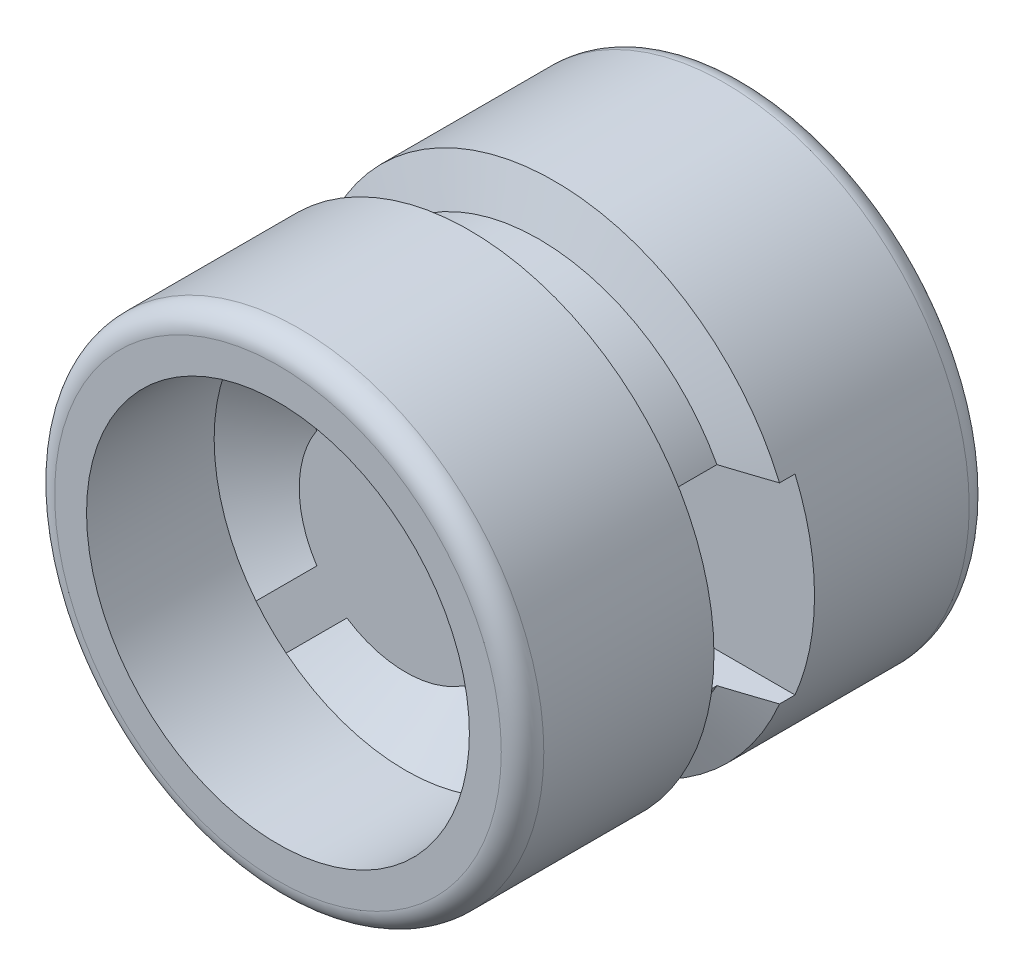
ISO-10303-21;
HEADER;
FILE_DESCRIPTION(('STEP AP214'),'2;1');
FILE_NAME('part.step','',(''),(''),'','','');
FILE_SCHEMA(('AUTOMOTIVE_DESIGN { 1 0 10303 214 1 1 1 1 }'));
ENDSEC;
DATA;
#1=APPLICATION_CONTEXT('core data for automotive mechanical design processes');
#2=APPLICATION_PROTOCOL_DEFINITION('international standard','automotive_design',2000,#1);
#3=PRODUCT_CONTEXT('',#1,'mechanical');
#4=PRODUCT('Part','Part','',(#3));
#5=PRODUCT_RELATED_PRODUCT_CATEGORY('part','',(#4));
#6=PRODUCT_DEFINITION_FORMATION('','',#4);
#7=PRODUCT_DEFINITION_CONTEXT('part definition',#1,'design');
#8=PRODUCT_DEFINITION('design','',#6,#7);
#9=PRODUCT_DEFINITION_SHAPE('','',#8);
#10=(LENGTH_UNIT() NAMED_UNIT(*) SI_UNIT(.MILLI.,.METRE.));
#11=(NAMED_UNIT(*) PLANE_ANGLE_UNIT() SI_UNIT($,.RADIAN.));
#12=(NAMED_UNIT(*) SI_UNIT($,.STERADIAN.) SOLID_ANGLE_UNIT());
#13=UNCERTAINTY_MEASURE_WITH_UNIT(LENGTH_MEASURE(1.E-05),#10,'distance_accuracy_value','');
#14=(GEOMETRIC_REPRESENTATION_CONTEXT(3) GLOBAL_UNCERTAINTY_ASSIGNED_CONTEXT((#13)) GLOBAL_UNIT_ASSIGNED_CONTEXT((#10,
#11,#12)) REPRESENTATION_CONTEXT('',''));
#15=CARTESIAN_POINT('',(0.,0.,0.));
#16=DIRECTION('',(0.,0.,1.));
#17=DIRECTION('',(1.,0.,0.));
#18=AXIS2_PLACEMENT_3D('',#15,#16,#17);
#19=CARTESIAN_POINT('',(0.,5.75,-5.5));
#20=DIRECTION('',(0.,0.,1.));
#21=DIRECTION('',(1.,0.,0.));
#22=AXIS2_PLACEMENT_3D('',#19,#20,#21);
#23=PLANE('',#22);
#24=CARTESIAN_POINT('',(0.,0.,-5.5));
#25=DIRECTION('',(0.,0.,-1.));
#26=DIRECTION('',(-1.,0.,0.));
#27=AXIS2_PLACEMENT_3D('',#24,#25,#26);
#28=CIRCLE('',#27,1.5);
#29=CARTESIAN_POINT('',(-1.5,0.,-5.5));
#30=VERTEX_POINT('',#29);
#31=EDGE_CURVE('E402',#30,#30,#28,.T.);
#32=ORIENTED_EDGE('',*,*,#31,.F.);
#33=EDGE_LOOP('',(#32));
#34=FACE_BOUND('',#33,.T.);
#35=CARTESIAN_POINT('',(0.,0.,-5.5));
#36=DIRECTION('',(0.,0.,-1.));
#37=DIRECTION('',(-1.,0.,0.));
#38=AXIS2_PLACEMENT_3D('',#35,#36,#37);
#39=CIRCLE('',#38,3.);
#40=CARTESIAN_POINT('',(-3.,0.,-5.5));
#41=VERTEX_POINT('',#40);
#42=EDGE_CURVE('E289',#41,#41,#39,.T.);
#43=ORIENTED_EDGE('',*,*,#42,.T.);
#44=EDGE_LOOP('',(#43));
#45=FACE_BOUND('',#44,.T.);
#46=ADVANCED_FACE('F32',(#34,#45),#23,.F.);
#47=CARTESIAN_POINT('',(0.,0.,7.19287260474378));
#48=DIRECTION('',(0.,0.,1.));
#49=DIRECTION('',(1.,0.,0.));
#50=AXIS2_PLACEMENT_3D('',#47,#48,#49);
#51=CYLINDRICAL_SURFACE('',#50,4.75);
#52=CARTESIAN_POINT('',(0.,0.,-0.636029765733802));
#53=DIRECTION('',(0.,0.,1.));
#54=DIRECTION('',(1.,0.,0.));
#55=AXIS2_PLACEMENT_3D('',#52,#53,#54);
#56=CIRCLE('',#55,4.75);
#57=CARTESIAN_POINT('',(-4.18330013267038,-2.25,-0.636029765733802));
#58=VERTEX_POINT('',#57);
#59=CARTESIAN_POINT('',(4.18330013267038,-2.25,-0.636029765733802));
#60=VERTEX_POINT('',#59);
#61=EDGE_CURVE('E674',#58,#60,#56,.T.);
#62=ORIENTED_EDGE('',*,*,#61,.T.);
#63=DIRECTION('',(0.,0.,1.));
#64=VECTOR('',#63,1.);
#65=CARTESIAN_POINT('',(4.18330013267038,-2.25,7.19287260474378));
#66=LINE('',#65,#64);
#67=CARTESIAN_POINT('',(4.18330013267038,-2.25,0.636029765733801));
#68=VERTEX_POINT('',#67);
#69=EDGE_CURVE('E678',#60,#68,#66,.T.);
#70=ORIENTED_EDGE('',*,*,#69,.T.);
#71=CARTESIAN_POINT('',(0.,0.,0.636029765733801));
#72=DIRECTION('',(0.,0.,1.));
#73=DIRECTION('',(1.,0.,0.));
#74=AXIS2_PLACEMENT_3D('',#71,#72,#73);
#75=CIRCLE('',#74,4.75);
#76=CARTESIAN_POINT('',(-4.18330013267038,-2.25,0.636029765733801));
#77=VERTEX_POINT('',#76);
#78=EDGE_CURVE('E688',#77,#68,#75,.T.);
#79=ORIENTED_EDGE('',*,*,#78,.F.);
#80=DIRECTION('',(0.,0.,1.));
#81=VECTOR('',#80,1.);
#82=CARTESIAN_POINT('',(-4.18330013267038,-2.25,7.19287260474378));
#83=LINE('',#82,#81);
#84=EDGE_CURVE('E347',#77,#58,#83,.F.);
#85=ORIENTED_EDGE('',*,*,#84,.T.);
#86=EDGE_LOOP('',(#62,#70,#79,#85));
#87=FACE_BOUND('',#86,.T.);
#88=ADVANCED_FACE('F393',(#87),#51,.T.);
#89=CARTESIAN_POINT('',(0.,0.,-1.));
#90=DIRECTION('',(0.,0.,-1.));
#91=DIRECTION('',(-1.,0.,0.));
#92=AXIS2_PLACEMENT_3D('',#89,#90,#91);
#93=CONICAL_SURFACE('',#92,5.75,1.22173047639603);
#94=CARTESIAN_POINT('',(0.,0.,-1.));
#95=DIRECTION('',(0.,0.,1.));
#96=DIRECTION('',(1.,0.,0.));
#97=AXIS2_PLACEMENT_3D('',#94,#95,#96);
#98=CIRCLE('',#97,5.75);
#99=CARTESIAN_POINT('',(-5.29150262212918,-2.25,-0.999999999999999));
#100=VERTEX_POINT('',#99);
#101=CARTESIAN_POINT('',(5.29150262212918,-2.25,-0.999999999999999));
#102=VERTEX_POINT('',#101);
#103=EDGE_CURVE('E677',#100,#102,#98,.T.);
#104=ORIENTED_EDGE('',*,*,#103,.T.);
#105=CARTESIAN_POINT('',(12.6536549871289,-2.25,-3.58496730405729));
#106=CARTESIAN_POINT('',(12.3848221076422,-2.25,-3.48863289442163));
#107=CARTESIAN_POINT('',(12.1159603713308,-2.25,-3.39237891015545));
#108=CARTESIAN_POINT('',(11.5781640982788,-2.25,-3.20007383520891));
#109=CARTESIAN_POINT('',(11.3092295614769,-2.25,-3.10402274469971));
#110=CARTESIAN_POINT('',(10.5013842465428,-2.25,-2.81591238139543));
#111=CARTESIAN_POINT('',(9.96234172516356,-2.25,-2.6242224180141));
#112=CARTESIAN_POINT('',(8.84880483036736,-2.25,-2.22999600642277));
#113=CARTESIAN_POINT('',(8.27427452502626,-2.25,-2.02756076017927));
#114=CARTESIAN_POINT('',(7.41217700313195,-2.25,-1.72639114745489));
#115=CARTESIAN_POINT('',(7.12501355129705,-2.25,-1.62650193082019));
#116=CARTESIAN_POINT('',(6.55031296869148,-2.25,-1.42780539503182));
#117=CARTESIAN_POINT('',(6.26277583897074,-2.25,-1.32899807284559));
#118=CARTESIAN_POINT('',(5.71484474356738,-2.25,-1.14236153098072));
#119=CARTESIAN_POINT('',(5.45449927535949,-2.25,-1.05439024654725));
#120=CARTESIAN_POINT('',(4.9331976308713,-2.25,-0.880285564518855));
#121=CARTESIAN_POINT('',(4.67224146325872,-2.25,-0.794152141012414));
#122=CARTESIAN_POINT('',(4.14800346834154,-2.25,-0.624170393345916));
#123=CARTESIAN_POINT('',(3.88471672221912,-2.25,-0.540337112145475));
#124=CARTESIAN_POINT('',(3.48873581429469,-2.25,-0.417932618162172));
#125=CARTESIAN_POINT('',(3.35656017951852,-2.25,-0.377686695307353));
#126=CARTESIAN_POINT('',(3.0917747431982,-2.25,-0.298652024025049));
#127=CARTESIAN_POINT('',(2.95916494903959,-2.25,-0.259863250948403));
#128=CARTESIAN_POINT('',(2.69833001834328,-2.25,-0.185589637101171));
#129=CARTESIAN_POINT('',(2.57012466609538,-2.25,-0.150035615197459));
#130=CARTESIAN_POINT('',(2.31309047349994,-2.25,-0.0812386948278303));
#131=CARTESIAN_POINT('',(2.1842616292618,-2.25,-0.0479958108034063));
#132=CARTESIAN_POINT('',(1.92579519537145,-2.25,0.0154477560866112));
#133=CARTESIAN_POINT('',(1.7961573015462,-2.25,0.0456472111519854));
#134=CARTESIAN_POINT('',(1.5359888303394,-2.25,0.101998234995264));
#135=CARTESIAN_POINT('',(1.40545822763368,-2.25,0.128149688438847));
#136=CARTESIAN_POINT('',(1.14487319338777,-2.25,0.174891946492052));
#137=CARTESIAN_POINT('',(1.01482938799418,-2.25,0.19554089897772));
#138=CARTESIAN_POINT('',(0.753873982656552,-2.25,0.230279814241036));
#139=CARTESIAN_POINT('',(0.622962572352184,-2.25,0.244371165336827));
#140=CARTESIAN_POINT('',(0.360742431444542,-2.25,0.264743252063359));
#141=CARTESIAN_POINT('',(0.229434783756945,-2.25,0.271037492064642));
#142=CARTESIAN_POINT('',(-0.0333134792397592,-2.25,0.275199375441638));
#143=CARTESIAN_POINT('',(-0.164754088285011,-2.25,0.273067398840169));
#144=CARTESIAN_POINT('',(-0.421598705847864,-2.25,0.260879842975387));
#145=CARTESIAN_POINT('',(-0.547019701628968,-2.25,0.251168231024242));
#146=CARTESIAN_POINT('',(-0.797166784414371,-2.25,0.225113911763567));
#147=CARTESIAN_POINT('',(-0.921892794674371,-2.25,0.208770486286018));
#148=CARTESIAN_POINT('',(-1.17074236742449,-2.25,0.170585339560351));
#149=CARTESIAN_POINT('',(-1.29486418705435,-2.25,0.148732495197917));
#150=CARTESIAN_POINT('',(-1.54225594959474,-2.25,0.100711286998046));
#151=CARTESIAN_POINT('',(-1.66552590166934,-2.25,0.0745429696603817));
#152=CARTESIAN_POINT('',(-1.91277083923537,-2.25,0.0185483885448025));
#153=CARTESIAN_POINT('',(-2.03673668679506,-2.25,-0.0113177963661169));
#154=CARTESIAN_POINT('',(-2.28400633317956,-2.25,-0.0736510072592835));
#155=CARTESIAN_POINT('',(-2.40731013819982,-2.25,-0.106118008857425));
#156=CARTESIAN_POINT('',(-2.65325859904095,-2.25,-0.17301384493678));
#157=CARTESIAN_POINT('',(-2.7759037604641,-2.25,-0.207440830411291));
#158=CARTESIAN_POINT('',(-3.0207514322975,-2.25,-0.277838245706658));
#159=CARTESIAN_POINT('',(-3.14295393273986,-2.25,-0.313808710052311));
#160=CARTESIAN_POINT('',(-3.51846582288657,-2.25,-0.426337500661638));
#161=CARTESIAN_POINT('',(-3.77118189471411,-2.25,-0.504872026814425));
#162=CARTESIAN_POINT('',(-4.27560093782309,-2.25,-0.66512412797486));
#163=CARTESIAN_POINT('',(-4.5273038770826,-2.25,-0.746841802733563));
#164=CARTESIAN_POINT('',(-5.02869953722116,-2.25,-0.911949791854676));
#165=CARTESIAN_POINT('',(-5.27839588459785,-2.25,-0.995329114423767));
#166=CARTESIAN_POINT('',(-5.77729012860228,-2.25,-1.16351585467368));
#167=CARTESIAN_POINT('',(-6.0264880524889,-2.25,-1.24832319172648));
#168=CARTESIAN_POINT('',(-6.54934213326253,-2.25,-1.42746032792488));
#169=CARTESIAN_POINT('',(-6.82296160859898,-2.25,-1.52189707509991));
#170=CARTESIAN_POINT('',(-7.36989278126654,-2.25,-1.7116566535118));
#171=CARTESIAN_POINT('',(-7.64320447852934,-2.25,-1.8069794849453));
#172=CARTESIAN_POINT('',(-8.46377069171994,-2.25,-2.09425547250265));
#173=CARTESIAN_POINT('',(-9.01068457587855,-2.25,-2.28718106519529));
#174=CARTESIAN_POINT('',(-10.0742084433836,-2.25,-2.66397696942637));
#175=CARTESIAN_POINT('',(-10.5908465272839,-2.25,-2.84776816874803));
#176=CARTESIAN_POINT('',(-11.6229040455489,-2.25,-3.21594735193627));
#177=CARTESIAN_POINT('',(-12.1383240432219,-2.25,-3.40033375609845));
#178=CARTESIAN_POINT('',(-12.6536549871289,-2.25,-3.58496730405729));
#179=B_SPLINE_CURVE_WITH_KNOTS('',3,(#105,#106,#107,#108,#109,#110,#111,#112,#113,#114,#115,
#116,#117,#118,#119,#120,#121,#122,#123,#124,#125,#126,#127,#128,#129,#130,#131,#132,#133,#134,
#135,#136,#137,#138,#139,#140,#141,#142,#143,#144,#145,#146,#147,#148,#149,#150,#151,#152,#153,
#154,#155,#156,#157,#158,#159,#160,#161,#162,#163,#164,#165,#166,#167,#168,#169,#170,#171,#172,
#173,#174,#175,#176,#177,#178),.UNSPECIFIED.,.F.,.F.,(4,2,2,2,2,2,2,2,2,2,2,2,2,2,2,2,2,2,2,2,2,
2,2,2,2,2,2,2,2,2,2,2,2,2,2,2,4),(0.,0.856716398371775,1.71343351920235,3.42976794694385,
5.25721534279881,6.16933577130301,7.08145364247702,7.90586869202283,8.730272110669,
9.55917639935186,9.97367144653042,10.3881594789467,10.7872753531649,11.1863937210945,
11.5856724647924,11.9849625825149,12.3798488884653,12.7746515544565,13.1687694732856,
13.5628696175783,13.9400569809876,14.3172852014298,14.6952812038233,15.0732731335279,
15.4557752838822,15.8382738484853,16.2204173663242,16.6025694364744,17.3964415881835,
18.1903386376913,18.9800808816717,19.7697786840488,20.6381503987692,21.506522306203,
23.2463497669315,24.8914165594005,26.5336411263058),.UNSPECIFIED.);
#180=EDGE_CURVE('E349',#102,#60,#179,.T.);
#181=ORIENTED_EDGE('',*,*,#180,.T.);
#182=ORIENTED_EDGE('',*,*,#61,.F.);
#183=EDGE_CURVE('E339',#58,#100,#179,.T.);
#184=ORIENTED_EDGE('',*,*,#183,.T.);
#185=EDGE_LOOP('',(#104,#181,#182,#184));
#186=FACE_BOUND('',#185,.T.);
#187=ADVANCED_FACE('F360',(#186),#93,.T.);
#188=CARTESIAN_POINT('',(0.,0.,7.19287260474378));
#189=DIRECTION('',(0.,0.,1.));
#190=DIRECTION('',(1.,0.,0.));
#191=AXIS2_PLACEMENT_3D('',#188,#189,#190);
#192=CYLINDRICAL_SURFACE('',#191,5.75);
#193=CARTESIAN_POINT('',(0.,0.,5.));
#194=DIRECTION('',(0.,0.,1.));
#195=DIRECTION('',(1.,0.,0.));
#196=AXIS2_PLACEMENT_3D('',#193,#194,#195);
#197=CIRCLE('',#196,5.75);
#198=CARTESIAN_POINT('',(5.75,0.,5.));
#199=VERTEX_POINT('',#198);
#200=EDGE_CURVE('E643',#199,#199,#197,.F.);
#201=ORIENTED_EDGE('',*,*,#200,.T.);
#202=EDGE_LOOP('',(#201));
#203=FACE_BOUND('',#202,.T.);
#204=CARTESIAN_POINT('',(0.,0.,1.));
#205=DIRECTION('',(0.,0.,1.));
#206=DIRECTION('',(1.,0.,0.));
#207=AXIS2_PLACEMENT_3D('',#204,#205,#206);
#208=CIRCLE('',#207,5.75);
#209=CARTESIAN_POINT('',(5.75,0.,1.));
#210=VERTEX_POINT('',#209);
#211=EDGE_CURVE('E661',#210,#210,#208,.T.);
#212=ORIENTED_EDGE('',*,*,#211,.T.);
#213=EDGE_LOOP('',(#212));
#214=FACE_BOUND('',#213,.T.);
#215=ADVANCED_FACE('F705',(#203,#214),#192,.T.);
#216=CARTESIAN_POINT('',(0.,0.,0.636029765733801));
#217=DIRECTION('',(0.,0.,1.));
#218=DIRECTION('',(1.,0.,0.));
#219=AXIS2_PLACEMENT_3D('',#216,#217,#218);
#220=CONICAL_SURFACE('',#219,4.75,1.22173047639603);
#221=ORIENTED_EDGE('',*,*,#211,.F.);
#222=EDGE_LOOP('',(#221));
#223=FACE_BOUND('',#222,.T.);
#224=CARTESIAN_POINT('',(4.18330013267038,2.25,0.636029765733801));
#225=VERTEX_POINT('',#224);
#226=CARTESIAN_POINT('',(-4.18330013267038,2.25,0.636029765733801));
#227=VERTEX_POINT('',#226);
#228=EDGE_CURVE('E664',#225,#227,#75,.T.);
#229=ORIENTED_EDGE('',*,*,#228,.T.);
#230=EDGE_CURVE('E669',#227,#77,#75,.T.);
#231=ORIENTED_EDGE('',*,*,#230,.T.);
#232=ORIENTED_EDGE('',*,*,#78,.T.);
#233=EDGE_CURVE('E670',#68,#225,#75,.T.);
#234=ORIENTED_EDGE('',*,*,#233,.T.);
#235=EDGE_LOOP('',(#229,#231,#232,#234));
#236=FACE_BOUND('',#235,.T.);
#237=ADVANCED_FACE('F695',(#223,#236),#220,.T.);
#238=CARTESIAN_POINT('',(4.18330013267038,2.25,-0.636029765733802));
#239=VERTEX_POINT('',#238);
#240=CARTESIAN_POINT('',(-4.18330013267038,2.25,-0.636029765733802));
#241=VERTEX_POINT('',#240);
#242=EDGE_CURVE('E671',#239,#241,#56,.T.);
#243=ORIENTED_EDGE('',*,*,#242,.T.);
#244=DIRECTION('',(0.,0.,1.));
#245=VECTOR('',#244,1.);
#246=CARTESIAN_POINT('',(-4.18330013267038,2.25,7.19287260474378));
#247=LINE('',#246,#245);
#248=EDGE_CURVE('E348',#241,#227,#247,.T.);
#249=ORIENTED_EDGE('',*,*,#248,.T.);
#250=ORIENTED_EDGE('',*,*,#228,.F.);
#251=DIRECTION('',(0.,0.,1.));
#252=VECTOR('',#251,1.);
#253=CARTESIAN_POINT('',(4.18330013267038,2.25,7.19287260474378));
#254=LINE('',#253,#252);
#255=EDGE_CURVE('E371',#225,#239,#254,.F.);
#256=ORIENTED_EDGE('',*,*,#255,.T.);
#257=EDGE_LOOP('',(#243,#249,#250,#256));
#258=FACE_BOUND('',#257,.T.);
#259=ADVANCED_FACE('F358',(#258),#51,.T.);
#260=CARTESIAN_POINT('',(5.29150262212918,2.25,-1.));
#261=VERTEX_POINT('',#260);
#262=CARTESIAN_POINT('',(-5.29150262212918,2.25,-1.));
#263=VERTEX_POINT('',#262);
#264=EDGE_CURVE('E675',#261,#263,#98,.T.);
#265=ORIENTED_EDGE('',*,*,#264,.T.);
#266=CARTESIAN_POINT('',(-12.6536549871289,2.25,-3.58496730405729));
#267=CARTESIAN_POINT('',(-12.3848221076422,2.25,-3.48863289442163));
#268=CARTESIAN_POINT('',(-12.1159603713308,2.25,-3.39237891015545));
#269=CARTESIAN_POINT('',(-11.5781640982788,2.25,-3.20007383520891));
#270=CARTESIAN_POINT('',(-11.3092295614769,2.25,-3.10402274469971));
#271=CARTESIAN_POINT('',(-10.5013842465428,2.25,-2.81591238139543));
#272=CARTESIAN_POINT('',(-9.96234172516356,2.25,-2.6242224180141));
#273=CARTESIAN_POINT('',(-8.84880483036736,2.25,-2.22999600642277));
#274=CARTESIAN_POINT('',(-8.27427452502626,2.25,-2.02756076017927));
#275=CARTESIAN_POINT('',(-7.41217700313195,2.25,-1.72639114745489));
#276=CARTESIAN_POINT('',(-7.12501355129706,2.25,-1.62650193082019));
#277=CARTESIAN_POINT('',(-6.55031296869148,2.25,-1.42780539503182));
#278=CARTESIAN_POINT('',(-6.26277583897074,2.25,-1.32899807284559));
#279=CARTESIAN_POINT('',(-5.71484474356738,2.25,-1.14236153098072));
#280=CARTESIAN_POINT('',(-5.45449927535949,2.25,-1.05439024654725));
#281=CARTESIAN_POINT('',(-4.9331976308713,2.25,-0.880285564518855));
#282=CARTESIAN_POINT('',(-4.67224146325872,2.25,-0.794152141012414));
#283=CARTESIAN_POINT('',(-4.14800346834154,2.25,-0.624170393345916));
#284=CARTESIAN_POINT('',(-3.88471672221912,2.25,-0.540337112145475));
#285=CARTESIAN_POINT('',(-3.48873581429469,2.25,-0.417932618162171));
#286=CARTESIAN_POINT('',(-3.35656017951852,2.25,-0.377686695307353));
#287=CARTESIAN_POINT('',(-3.0917747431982,2.25,-0.298652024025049));
#288=CARTESIAN_POINT('',(-2.95916494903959,2.25,-0.259863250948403));
#289=CARTESIAN_POINT('',(-2.69833001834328,2.25,-0.18558963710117));
#290=CARTESIAN_POINT('',(-2.57012466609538,2.25,-0.150035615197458));
#291=CARTESIAN_POINT('',(-2.31309047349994,2.25,-0.0812386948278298));
#292=CARTESIAN_POINT('',(-2.1842616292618,2.25,-0.047995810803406));
#293=CARTESIAN_POINT('',(-1.92579519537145,2.25,0.0154477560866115));
#294=CARTESIAN_POINT('',(-1.7961573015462,2.25,0.0456472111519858));
#295=CARTESIAN_POINT('',(-1.5359888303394,2.25,0.101998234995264));
#296=CARTESIAN_POINT('',(-1.40545822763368,2.25,0.128149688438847));
#297=CARTESIAN_POINT('',(-1.14487319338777,2.25,0.174891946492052));
#298=CARTESIAN_POINT('',(-1.01482938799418,2.25,0.19554089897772));
#299=CARTESIAN_POINT('',(-0.753873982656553,2.25,0.230279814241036));
#300=CARTESIAN_POINT('',(-0.622962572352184,2.25,0.244371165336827));
#301=CARTESIAN_POINT('',(-0.360742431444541,2.25,0.264743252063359));
#302=CARTESIAN_POINT('',(-0.229434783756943,2.25,0.271037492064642));
#303=CARTESIAN_POINT('',(0.0333134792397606,2.25,0.275199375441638));
#304=CARTESIAN_POINT('',(0.164754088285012,2.25,0.273067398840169));
#305=CARTESIAN_POINT('',(0.421598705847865,2.25,0.260879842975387));
#306=CARTESIAN_POINT('',(0.547019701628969,2.25,0.251168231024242));
#307=CARTESIAN_POINT('',(0.797166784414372,2.25,0.225113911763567));
#308=CARTESIAN_POINT('',(0.921892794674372,2.25,0.208770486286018));
#309=CARTESIAN_POINT('',(1.17074236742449,2.25,0.170585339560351));
#310=CARTESIAN_POINT('',(1.29486418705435,2.25,0.148732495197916));
#311=CARTESIAN_POINT('',(1.54225594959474,2.25,0.100711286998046));
#312=CARTESIAN_POINT('',(1.66552590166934,2.25,0.0745429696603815));
#313=CARTESIAN_POINT('',(1.91277083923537,2.25,0.0185483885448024));
#314=CARTESIAN_POINT('',(2.03673668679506,2.25,-0.0113177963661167));
#315=CARTESIAN_POINT('',(2.28400633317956,2.25,-0.0736510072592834));
#316=CARTESIAN_POINT('',(2.40731013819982,2.25,-0.106118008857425));
#317=CARTESIAN_POINT('',(2.65325859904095,2.25,-0.17301384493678));
#318=CARTESIAN_POINT('',(2.7759037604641,2.25,-0.207440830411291));
#319=CARTESIAN_POINT('',(3.0207514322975,2.25,-0.277838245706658));
#320=CARTESIAN_POINT('',(3.14295393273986,2.25,-0.313808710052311));
#321=CARTESIAN_POINT('',(3.51846582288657,2.25,-0.426337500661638));
#322=CARTESIAN_POINT('',(3.77118189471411,2.25,-0.504872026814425));
#323=CARTESIAN_POINT('',(4.27560093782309,2.25,-0.665124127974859));
#324=CARTESIAN_POINT('',(4.5273038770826,2.25,-0.746841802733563));
#325=CARTESIAN_POINT('',(5.02869953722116,2.25,-0.911949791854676));
#326=CARTESIAN_POINT('',(5.27839588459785,2.25,-0.995329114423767));
#327=CARTESIAN_POINT('',(5.77729012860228,2.25,-1.16351585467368));
#328=CARTESIAN_POINT('',(6.0264880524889,2.25,-1.24832319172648));
#329=CARTESIAN_POINT('',(6.54934213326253,2.25,-1.42746032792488));
#330=CARTESIAN_POINT('',(6.82296160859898,2.25,-1.52189707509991));
#331=CARTESIAN_POINT('',(7.36989278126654,2.25,-1.7116566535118));
#332=CARTESIAN_POINT('',(7.64320447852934,2.25,-1.8069794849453));
#333=CARTESIAN_POINT('',(8.46377069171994,2.25,-2.09425547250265));
#334=CARTESIAN_POINT('',(9.01068457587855,2.25,-2.28718106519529));
#335=CARTESIAN_POINT('',(10.0742084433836,2.25,-2.66397696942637));
#336=CARTESIAN_POINT('',(10.5908465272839,2.25,-2.84776816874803));
#337=CARTESIAN_POINT('',(11.6229040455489,2.25,-3.21594735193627));
#338=CARTESIAN_POINT('',(12.1383240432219,2.25,-3.40033375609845));
#339=CARTESIAN_POINT('',(12.6536549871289,2.25,-3.58496730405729));
#340=B_SPLINE_CURVE_WITH_KNOTS('',3,(#266,#267,#268,#269,#270,#271,#272,#273,#274,#275,#276,
#277,#278,#279,#280,#281,#282,#283,#284,#285,#286,#287,#288,#289,#290,#291,#292,#293,#294,#295,
#296,#297,#298,#299,#300,#301,#302,#303,#304,#305,#306,#307,#308,#309,#310,#311,#312,#313,#314,
#315,#316,#317,#318,#319,#320,#321,#322,#323,#324,#325,#326,#327,#328,#329,#330,#331,#332,#333,
#334,#335,#336,#337,#338,#339),.UNSPECIFIED.,.F.,.F.,(4,2,2,2,2,2,2,2,2,2,2,2,2,2,2,2,2,2,2,2,2,
2,2,2,2,2,2,2,2,2,2,2,2,2,2,2,4),(0.,0.856716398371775,1.71343351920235,3.42976794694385,
5.25721534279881,6.16933577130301,7.08145364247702,7.90586869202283,8.730272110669,
9.55917639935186,9.97367144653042,10.3881594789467,10.7872753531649,11.1863937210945,
11.5856724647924,11.9849625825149,12.3798488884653,12.7746515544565,13.1687694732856,
13.5628696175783,13.9400569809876,14.3172852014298,14.6952812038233,15.0732731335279,
15.4557752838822,15.8382738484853,16.2204173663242,16.6025694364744,17.3964415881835,
18.1903386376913,18.9800808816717,19.7697786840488,20.6381503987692,21.506522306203,
23.2463497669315,24.8914165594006,26.5336411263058),.UNSPECIFIED.);
#341=EDGE_CURVE('E373',#263,#241,#340,.T.);
#342=ORIENTED_EDGE('',*,*,#341,.T.);
#343=ORIENTED_EDGE('',*,*,#242,.F.);
#344=EDGE_CURVE('E365',#239,#261,#340,.T.);
#345=ORIENTED_EDGE('',*,*,#344,.T.);
#346=EDGE_LOOP('',(#265,#342,#343,#345));
#347=FACE_BOUND('',#346,.T.);
#348=ADVANCED_FACE('F352',(#347),#93,.T.);
#349=CARTESIAN_POINT('',(0.,0.,7.19287260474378));
#350=DIRECTION('',(0.,0.,1.));
#351=DIRECTION('',(1.,0.,0.));
#352=AXIS2_PLACEMENT_3D('',#349,#350,#351);
#353=CYLINDRICAL_SURFACE('',#352,5.75);
#354=CARTESIAN_POINT('',(0.,0.,-5.));
#355=DIRECTION('',(0.,0.,1.));
#356=DIRECTION('',(1.,0.,0.));
#357=AXIS2_PLACEMENT_3D('',#354,#355,#356);
#358=CIRCLE('',#357,5.75);
#359=CARTESIAN_POINT('',(5.75,0.,-5.));
#360=VERTEX_POINT('',#359);
#361=EDGE_CURVE('E40',#360,#360,#358,.T.);
#362=ORIENTED_EDGE('',*,*,#361,.T.);
#363=EDGE_LOOP('',(#362));
#364=FACE_BOUND('',#363,.T.);
#365=ORIENTED_EDGE('',*,*,#103,.F.);
#366=DIRECTION('',(0.,0.,1.));
#367=VECTOR('',#366,1.);
#368=CARTESIAN_POINT('',(-5.29150262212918,-2.25,7.19287260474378));
#369=LINE('',#368,#367);
#370=CARTESIAN_POINT('',(-5.29150262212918,-2.25,-1.3639702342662));
#371=VERTEX_POINT('',#370);
#372=EDGE_CURVE('E436',#100,#371,#369,.F.);
#373=ORIENTED_EDGE('',*,*,#372,.T.);
#374=CARTESIAN_POINT('',(0.,0.,-1.3639702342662));
#375=DIRECTION('',(0.,0.,-1.));
#376=DIRECTION('',(0.,1.,0.));
#377=AXIS2_PLACEMENT_3D('',#374,#375,#376);
#378=CIRCLE('',#377,5.75);
#379=CARTESIAN_POINT('',(-5.29150262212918,2.25,-1.3639702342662));
#380=VERTEX_POINT('',#379);
#381=EDGE_CURVE('E646',#371,#380,#378,.T.);
#382=ORIENTED_EDGE('',*,*,#381,.T.);
#383=DIRECTION('',(0.,0.,1.));
#384=VECTOR('',#383,1.);
#385=CARTESIAN_POINT('',(-5.29150262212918,2.25,7.19287260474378));
#386=LINE('',#385,#384);
#387=EDGE_CURVE('E650',#380,#263,#386,.T.);
#388=ORIENTED_EDGE('',*,*,#387,.T.);
#389=ORIENTED_EDGE('',*,*,#264,.F.);
#390=DIRECTION('',(0.,0.,1.));
#391=VECTOR('',#390,1.);
#392=CARTESIAN_POINT('',(5.29150262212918,2.25,7.19287260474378));
#393=LINE('',#392,#391);
#394=CARTESIAN_POINT('',(5.29150262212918,2.25,-1.3639702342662));
#395=VERTEX_POINT('',#394);
#396=EDGE_CURVE('E658',#261,#395,#393,.F.);
#397=ORIENTED_EDGE('',*,*,#396,.T.);
#398=CARTESIAN_POINT('',(5.29150262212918,-2.25,-1.3639702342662));
#399=VERTEX_POINT('',#398);
#400=EDGE_CURVE('E652',#395,#399,#378,.T.);
#401=ORIENTED_EDGE('',*,*,#400,.T.);
#402=DIRECTION('',(0.,0.,1.));
#403=VECTOR('',#402,1.);
#404=CARTESIAN_POINT('',(5.29150262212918,-2.25,7.19287260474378));
#405=LINE('',#404,#403);
#406=EDGE_CURVE('E654',#399,#102,#405,.T.);
#407=ORIENTED_EDGE('',*,*,#406,.T.);
#408=EDGE_LOOP('',(#365,#373,#382,#388,#389,#397,#401,#407));
#409=FACE_BOUND('',#408,.T.);
#410=ADVANCED_FACE('F357',(#364,#409),#353,.T.);
#411=CARTESIAN_POINT('',(0.,0.,-5.5));
#412=DIRECTION('',(0.,0.,1.));
#413=DIRECTION('',(1.,0.,0.));
#414=AXIS2_PLACEMENT_3D('',#411,#412,#413);
#415=CIRCLE('',#414,5.25);
#416=CARTESIAN_POINT('',(5.25,0.,-5.5));
#417=VERTEX_POINT('',#416);
#418=EDGE_CURVE('E11',#417,#417,#415,.F.);
#419=ORIENTED_EDGE('',*,*,#418,.T.);
#420=EDGE_LOOP('',(#419));
#421=FACE_BOUND('',#420,.T.);
#422=CARTESIAN_POINT('',(0.,0.,-5.5));
#423=DIRECTION('',(0.,0.,-1.));
#424=DIRECTION('',(-1.,0.,0.));
#425=AXIS2_PLACEMENT_3D('',#422,#423,#424);
#426=CIRCLE('',#425,4.5);
#427=CARTESIAN_POINT('',(-4.5,0.,-5.5));
#428=VERTEX_POINT('',#427);
#429=EDGE_CURVE('E409',#428,#428,#426,.T.);
#430=ORIENTED_EDGE('',*,*,#429,.F.);
#431=EDGE_LOOP('',(#430));
#432=FACE_BOUND('',#431,.T.);
#433=ADVANCED_FACE('F382',(#421,#432),#23,.F.);
#434=CARTESIAN_POINT('',(-6.,2.25,0.636029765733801));
#435=DIRECTION('',(0.,0.,1.));
#436=DIRECTION('',(0.,-1.,0.));
#437=AXIS2_PLACEMENT_3D('',#434,#435,#436);
#438=PLANE('',#437);
#439=DIRECTION('',(-0.707106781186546,-0.707106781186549,0.));
#440=VECTOR('',#439,1.);
#441=CARTESIAN_POINT('',(-1.52144660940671,-2.22855339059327,0.6360297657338));
#442=LINE('',#441,#440);
#443=CARTESIAN_POINT('',(2.44520345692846,1.73809667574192,0.6360297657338));
#444=VERTEX_POINT('',#443);
#445=CARTESIAN_POINT('',(2.08560419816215,1.37849741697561,0.636029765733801));
#446=VERTEX_POINT('',#445);
#447=EDGE_CURVE('E550',#444,#446,#442,.T.);
#448=ORIENTED_EDGE('',*,*,#447,.T.);
#449=CARTESIAN_POINT('',(0.,0.,0.636029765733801));
#450=DIRECTION('',(0.,0.,1.));
#451=DIRECTION('',(0.,-1.,0.));
#452=AXIS2_PLACEMENT_3D('',#449,#450,#451);
#453=CIRCLE('',#452,2.5);
#454=CARTESIAN_POINT('',(2.08560419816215,-1.3784974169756,0.6360297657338));
#455=VERTEX_POINT('',#454);
#456=EDGE_CURVE('E546',#446,#455,#453,.F.);
#457=ORIENTED_EDGE('',*,*,#456,.T.);
#458=DIRECTION('',(0.70710678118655,-0.707106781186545,0.));
#459=VECTOR('',#458,1.);
#460=CARTESIAN_POINT('',(-3.77144660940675,4.47855339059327,0.636029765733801));
#461=LINE('',#460,#459);
#462=CARTESIAN_POINT('',(2.44520345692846,-1.73809667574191,0.6360297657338));
#463=VERTEX_POINT('',#462);
#464=EDGE_CURVE('E554',#455,#463,#461,.T.);
#465=ORIENTED_EDGE('',*,*,#464,.T.);
#466=CARTESIAN_POINT('',(0.,0.,0.636029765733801));
#467=DIRECTION('',(0.,0.,1.));
#468=DIRECTION('',(0.,-1.,0.));
#469=AXIS2_PLACEMENT_3D('',#466,#467,#468);
#470=CIRCLE('',#469,2.99999999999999);
#471=EDGE_CURVE('E212',#463,#444,#470,.T.);
#472=ORIENTED_EDGE('',*,*,#471,.T.);
#473=EDGE_LOOP('',(#448,#457,#465,#472));
#474=FACE_BOUND('',#473,.T.);
#475=DIRECTION('',(-0.707106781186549,0.707106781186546,0.));
#476=VECTOR('',#475,1.);
#477=CARTESIAN_POINT('',(-4.47855339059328,3.77144660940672,0.636029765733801));
#478=LINE('',#477,#476);
#479=CARTESIAN_POINT('',(-2.08560419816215,1.3784974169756,0.6360297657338));
#480=VERTEX_POINT('',#479);
#481=CARTESIAN_POINT('',(-2.44520345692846,1.73809667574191,0.636029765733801));
#482=VERTEX_POINT('',#481);
#483=EDGE_CURVE('E537',#480,#482,#478,.T.);
#484=ORIENTED_EDGE('',*,*,#483,.T.);
#485=CARTESIAN_POINT('',(0.,0.,0.636029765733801));
#486=DIRECTION('',(0.,0.,1.));
#487=DIRECTION('',(0.,-1.,0.));
#488=AXIS2_PLACEMENT_3D('',#485,#486,#487);
#489=CIRCLE('',#488,2.99999999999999);
#490=CARTESIAN_POINT('',(-2.44520345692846,-1.73809667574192,0.6360297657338));
#491=VERTEX_POINT('',#490);
#492=EDGE_CURVE('E531',#482,#491,#489,.T.);
#493=ORIENTED_EDGE('',*,*,#492,.T.);
#494=DIRECTION('',(0.707106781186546,0.707106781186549,0.));
#495=VECTOR('',#494,1.);
#496=CARTESIAN_POINT('',(-2.22855339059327,-1.52144660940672,0.6360297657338));
#497=LINE('',#496,#495);
#498=CARTESIAN_POINT('',(-2.08560419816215,-1.37849741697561,0.6360297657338));
#499=VERTEX_POINT('',#498);
#500=EDGE_CURVE('E541',#491,#499,#497,.T.);
#501=ORIENTED_EDGE('',*,*,#500,.T.);
#502=CARTESIAN_POINT('',(0.,0.,0.636029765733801));
#503=DIRECTION('',(0.,0.,1.));
#504=DIRECTION('',(0.,-1.,0.));
#505=AXIS2_PLACEMENT_3D('',#502,#503,#504);
#506=CIRCLE('',#505,2.5);
#507=EDGE_CURVE('E528',#499,#480,#506,.F.);
#508=ORIENTED_EDGE('',*,*,#507,.T.);
#509=EDGE_LOOP('',(#484,#493,#501,#508));
#510=FACE_BOUND('',#509,.T.);
#511=DIRECTION('',(1.,0.,0.));
#512=VECTOR('',#511,1.);
#513=CARTESIAN_POINT('',(-6.,-2.25,0.6360297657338));
#514=LINE('',#513,#512);
#515=EDGE_CURVE('E422',#77,#68,#514,.T.);
#516=ORIENTED_EDGE('',*,*,#515,.F.);
#517=ORIENTED_EDGE('',*,*,#230,.F.);
#518=DIRECTION('',(1.,0.,0.));
#519=VECTOR('',#518,1.);
#520=CARTESIAN_POINT('',(-6.,2.25,0.636029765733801));
#521=LINE('',#520,#519);
#522=EDGE_CURVE('E424',#227,#225,#521,.T.);
#523=ORIENTED_EDGE('',*,*,#522,.T.);
#524=ORIENTED_EDGE('',*,*,#233,.F.);
#525=EDGE_LOOP('',(#516,#517,#523,#524));
#526=FACE_BOUND('',#525,.T.);
#527=ADVANCED_FACE('F336',(#474,#510,#526),#438,.F.);
#528=CARTESIAN_POINT('',(-6.,2.25,-1.3639702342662));
#529=DIRECTION('',(0.,0.,-1.));
#530=DIRECTION('',(0.,1.,0.));
#531=AXIS2_PLACEMENT_3D('',#528,#529,#530);
#532=PLANE('',#531);
#533=CARTESIAN_POINT('',(0.,0.,-1.3639702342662));
#534=DIRECTION('',(0.,0.,-1.));
#535=DIRECTION('',(0.,1.,0.));
#536=AXIS2_PLACEMENT_3D('',#533,#534,#535);
#537=CIRCLE('',#536,1.5);
#538=CARTESIAN_POINT('',(0.,1.5,-1.3639702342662));
#539=VERTEX_POINT('',#538);
#540=EDGE_CURVE('E419',#539,#539,#537,.T.);
#541=ORIENTED_EDGE('',*,*,#540,.T.);
#542=EDGE_LOOP('',(#541));
#543=FACE_BOUND('',#542,.T.);
#544=DIRECTION('',(1.,0.,0.));
#545=VECTOR('',#544,1.);
#546=CARTESIAN_POINT('',(-6.,2.25,-1.3639702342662));
#547=LINE('',#546,#545);
#548=EDGE_CURVE('E374',#380,#395,#547,.T.);
#549=ORIENTED_EDGE('',*,*,#548,.F.);
#550=ORIENTED_EDGE('',*,*,#381,.F.);
#551=DIRECTION('',(1.,0.,0.));
#552=VECTOR('',#551,1.);
#553=CARTESIAN_POINT('',(-6.,-2.25,-1.3639702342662));
#554=LINE('',#553,#552);
#555=EDGE_CURVE('E372',#371,#399,#554,.T.);
#556=ORIENTED_EDGE('',*,*,#555,.T.);
#557=ORIENTED_EDGE('',*,*,#400,.F.);
#558=EDGE_LOOP('',(#549,#550,#556,#557));
#559=FACE_BOUND('',#558,.T.);
#560=ADVANCED_FACE('F334',(#543,#559),#532,.F.);
#561=CARTESIAN_POINT('',(-6.,-2.25,-1.3639702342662));
#562=DIRECTION('',(0.,-1.,0.));
#563=DIRECTION('',(0.,0.,-1.));
#564=AXIS2_PLACEMENT_3D('',#561,#562,#563);
#565=PLANE('',#564);
#566=ORIENTED_EDGE('',*,*,#180,.F.);
#567=ORIENTED_EDGE('',*,*,#406,.F.);
#568=ORIENTED_EDGE('',*,*,#555,.F.);
#569=ORIENTED_EDGE('',*,*,#372,.F.);
#570=ORIENTED_EDGE('',*,*,#183,.F.);
#571=ORIENTED_EDGE('',*,*,#84,.F.);
#572=ORIENTED_EDGE('',*,*,#515,.T.);
#573=ORIENTED_EDGE('',*,*,#69,.F.);
#574=EDGE_LOOP('',(#566,#567,#568,#569,#570,#571,#572,#573));
#575=FACE_BOUND('',#574,.T.);
#576=ADVANCED_FACE('F330',(#575),#565,.F.);
#577=CARTESIAN_POINT('',(-6.,2.25,-1.3639702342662));
#578=DIRECTION('',(0.,1.,0.));
#579=DIRECTION('',(0.,0.,1.));
#580=AXIS2_PLACEMENT_3D('',#577,#578,#579);
#581=PLANE('',#580);
#582=ORIENTED_EDGE('',*,*,#341,.F.);
#583=ORIENTED_EDGE('',*,*,#387,.F.);
#584=ORIENTED_EDGE('',*,*,#548,.T.);
#585=ORIENTED_EDGE('',*,*,#396,.F.);
#586=ORIENTED_EDGE('',*,*,#344,.F.);
#587=ORIENTED_EDGE('',*,*,#255,.F.);
#588=ORIENTED_EDGE('',*,*,#522,.F.);
#589=ORIENTED_EDGE('',*,*,#248,.F.);
#590=EDGE_LOOP('',(#582,#583,#584,#585,#586,#587,#588,#589));
#591=FACE_BOUND('',#590,.T.);
#592=ADVANCED_FACE('F328',(#591),#581,.F.);
#593=CARTESIAN_POINT('',(0.,0.,0.636029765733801));
#594=DIRECTION('',(0.,0.,-1.));
#595=DIRECTION('',(-1.,0.,0.));
#596=AXIS2_PLACEMENT_3D('',#593,#594,#595);
#597=CYLINDRICAL_SURFACE('',#596,1.5);
#598=ORIENTED_EDGE('',*,*,#31,.T.);
#599=EDGE_LOOP('',(#598));
#600=FACE_BOUND('',#599,.T.);
#601=ORIENTED_EDGE('',*,*,#540,.F.);
#602=EDGE_LOOP('',(#601));
#603=FACE_BOUND('',#602,.T.);
#604=ADVANCED_FACE('F324',(#600,#603),#597,.F.);
#605=CARTESIAN_POINT('',(0.,0.,-3.));
#606=DIRECTION('',(0.,0.,-1.));
#607=DIRECTION('',(-1.,0.,0.));
#608=AXIS2_PLACEMENT_3D('',#605,#606,#607);
#609=CYLINDRICAL_SURFACE('',#608,4.5);
#610=CARTESIAN_POINT('',(0.,0.,-3.));
#611=DIRECTION('',(0.,0.,-1.));
#612=DIRECTION('',(-1.,0.,0.));
#613=AXIS2_PLACEMENT_3D('',#610,#611,#612);
#614=CIRCLE('',#613,4.5);
#615=CARTESIAN_POINT('',(-4.5,0.,-3.));
#616=VERTEX_POINT('',#615);
#617=EDGE_CURVE('E413',#616,#616,#614,.T.);
#618=ORIENTED_EDGE('',*,*,#617,.F.);
#619=EDGE_LOOP('',(#618));
#620=FACE_BOUND('',#619,.T.);
#621=ORIENTED_EDGE('',*,*,#429,.T.);
#622=EDGE_LOOP('',(#621));
#623=FACE_BOUND('',#622,.T.);
#624=ADVANCED_FACE('F320',(#620,#623),#609,.F.);
#625=CARTESIAN_POINT('',(0.,0.,-3.));
#626=DIRECTION('',(0.,0.,-1.));
#627=DIRECTION('',(-1.,0.,0.));
#628=AXIS2_PLACEMENT_3D('',#625,#626,#627);
#629=PLANE('',#628);
#630=CARTESIAN_POINT('',(0.,0.,-3.));
#631=DIRECTION('',(0.,0.,-1.));
#632=DIRECTION('',(-1.,0.,0.));
#633=AXIS2_PLACEMENT_3D('',#630,#631,#632);
#634=CIRCLE('',#633,3.);
#635=CARTESIAN_POINT('',(-3.,0.,-3.));
#636=VERTEX_POINT('',#635);
#637=EDGE_CURVE('E406',#636,#636,#634,.T.);
#638=ORIENTED_EDGE('',*,*,#637,.F.);
#639=EDGE_LOOP('',(#638));
#640=FACE_BOUND('',#639,.T.);
#641=ORIENTED_EDGE('',*,*,#617,.T.);
#642=EDGE_LOOP('',(#641));
#643=FACE_BOUND('',#642,.T.);
#644=ADVANCED_FACE('F316',(#640,#643),#629,.T.);
#645=CARTESIAN_POINT('',(0.,0.,-3.));
#646=DIRECTION('',(0.,0.,-1.));
#647=DIRECTION('',(-1.,0.,0.));
#648=AXIS2_PLACEMENT_3D('',#645,#646,#647);
#649=CYLINDRICAL_SURFACE('',#648,3.);
#650=ORIENTED_EDGE('',*,*,#637,.T.);
#651=EDGE_LOOP('',(#650));
#652=FACE_BOUND('',#651,.T.);
#653=ORIENTED_EDGE('',*,*,#42,.F.);
#654=EDGE_LOOP('',(#653));
#655=FACE_BOUND('',#654,.T.);
#656=ADVANCED_FACE('F312',(#652,#655),#649,.T.);
#657=CARTESIAN_POINT('',(0.,0.,5.5));
#658=DIRECTION('',(0.,0.,1.));
#659=DIRECTION('',(1.,0.,0.));
#660=AXIS2_PLACEMENT_3D('',#657,#658,#659);
#661=PLANE('',#660);
#662=CARTESIAN_POINT('',(0.,0.,5.5));
#663=DIRECTION('',(0.,0.,1.));
#664=DIRECTION('',(1.,0.,0.));
#665=AXIS2_PLACEMENT_3D('',#662,#663,#664);
#666=CIRCLE('',#665,5.25);
#667=CARTESIAN_POINT('',(5.25,0.,5.5));
#668=VERTEX_POINT('',#667);
#669=EDGE_CURVE('E248',#668,#668,#666,.T.);
#670=ORIENTED_EDGE('',*,*,#669,.T.);
#671=EDGE_LOOP('',(#670));
#672=FACE_BOUND('',#671,.T.);
#673=CARTESIAN_POINT('',(0.,0.,5.5));
#674=DIRECTION('',(0.,0.,1.));
#675=DIRECTION('',(1.,0.,0.));
#676=AXIS2_PLACEMENT_3D('',#673,#674,#675);
#677=CIRCLE('',#676,4.5);
#678=CARTESIAN_POINT('',(4.5,0.,5.5));
#679=VERTEX_POINT('',#678);
#680=EDGE_CURVE('E521',#679,#679,#677,.T.);
#681=ORIENTED_EDGE('',*,*,#680,.F.);
#682=EDGE_LOOP('',(#681));
#683=FACE_BOUND('',#682,.T.);
#684=ADVANCED_FACE('F315',(#672,#683),#661,.T.);
#685=CARTESIAN_POINT('',(0.,0.,5.5));
#686=DIRECTION('',(0.,0.,-1.));
#687=DIRECTION('',(-1.,0.,0.));
#688=AXIS2_PLACEMENT_3D('',#685,#686,#687);
#689=CYLINDRICAL_SURFACE('',#688,4.5);
#690=ORIENTED_EDGE('',*,*,#680,.T.);
#691=EDGE_LOOP('',(#690));
#692=FACE_BOUND('',#691,.T.);
#693=CARTESIAN_POINT('',(0.,0.,2.5));
#694=DIRECTION('',(0.,0.,1.));
#695=DIRECTION('',(1.,0.,0.));
#696=AXIS2_PLACEMENT_3D('',#693,#694,#695);
#697=CIRCLE('',#696,4.5);
#698=CARTESIAN_POINT('',(3.51583105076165,2.80872426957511,2.5));
#699=VERTEX_POINT('',#698);
#700=CARTESIAN_POINT('',(2.8087242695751,3.51583105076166,2.5));
#701=VERTEX_POINT('',#700);
#702=EDGE_CURVE('E483',#699,#701,#697,.T.);
#703=ORIENTED_EDGE('',*,*,#702,.F.);
#704=CARTESIAN_POINT('',(0.,0.,2.5));
#705=DIRECTION('',(0.,0.,1.));
#706=DIRECTION('',(1.,0.,0.));
#707=AXIS2_PLACEMENT_3D('',#704,#705,#706);
#708=CIRCLE('',#707,4.5);
#709=CARTESIAN_POINT('',(3.51583105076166,-2.8087242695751,2.5));
#710=VERTEX_POINT('',#709);
#711=EDGE_CURVE('E523',#710,#699,#708,.T.);
#712=ORIENTED_EDGE('',*,*,#711,.F.);
#713=CARTESIAN_POINT('',(0.,0.,2.5));
#714=DIRECTION('',(0.,0.,1.));
#715=DIRECTION('',(1.,0.,0.));
#716=AXIS2_PLACEMENT_3D('',#713,#714,#715);
#717=CIRCLE('',#716,4.5);
#718=CARTESIAN_POINT('',(2.80872426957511,-3.51583105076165,2.5));
#719=VERTEX_POINT('',#718);
#720=EDGE_CURVE('E468',#719,#710,#717,.T.);
#721=ORIENTED_EDGE('',*,*,#720,.F.);
#722=CARTESIAN_POINT('',(-2.80872426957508,-3.51583105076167,2.5));
#723=VERTEX_POINT('',#722);
#724=EDGE_CURVE('E527',#723,#719,#708,.T.);
#725=ORIENTED_EDGE('',*,*,#724,.F.);
#726=CARTESIAN_POINT('',(0.,0.,2.5));
#727=DIRECTION('',(0.,0.,1.));
#728=DIRECTION('',(1.,0.,0.));
#729=AXIS2_PLACEMENT_3D('',#726,#727,#728);
#730=CIRCLE('',#729,4.5);
#731=CARTESIAN_POINT('',(-3.51583105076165,-2.80872426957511,2.5));
#732=VERTEX_POINT('',#731);
#733=EDGE_CURVE('E453',#732,#723,#730,.T.);
#734=ORIENTED_EDGE('',*,*,#733,.F.);
#735=CARTESIAN_POINT('',(-3.51583105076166,2.8087242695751,2.5));
#736=VERTEX_POINT('',#735);
#737=EDGE_CURVE('E522',#736,#732,#708,.T.);
#738=ORIENTED_EDGE('',*,*,#737,.F.);
#739=CARTESIAN_POINT('',(0.,0.,2.5));
#740=DIRECTION('',(0.,0.,1.));
#741=DIRECTION('',(1.,0.,0.));
#742=AXIS2_PLACEMENT_3D('',#739,#740,#741);
#743=CIRCLE('',#742,4.5);
#744=CARTESIAN_POINT('',(-2.80872426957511,3.51583105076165,2.5));
#745=VERTEX_POINT('',#744);
#746=EDGE_CURVE('E304',#745,#736,#743,.T.);
#747=ORIENTED_EDGE('',*,*,#746,.F.);
#748=EDGE_CURVE('E519',#701,#745,#708,.T.);
#749=ORIENTED_EDGE('',*,*,#748,.F.);
#750=EDGE_LOOP('',(#703,#712,#721,#725,#734,#738,#747,#749));
#751=FACE_BOUND('',#750,.T.);
#752=ADVANCED_FACE('F272',(#692,#751),#689,.F.);
#753=CARTESIAN_POINT('',(0.,0.,0.999999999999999));
#754=DIRECTION('',(0.,0.,1.));
#755=DIRECTION('',(1.,0.,0.));
#756=AXIS2_PLACEMENT_3D('',#753,#754,#755);
#757=PLANE('',#756);
#758=CARTESIAN_POINT('',(0.,0.,0.999999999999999));
#759=DIRECTION('',(0.,0.,1.));
#760=DIRECTION('',(1.,0.,0.));
#761=AXIS2_PLACEMENT_3D('',#758,#759,#760);
#762=CIRCLE('',#761,2.99999999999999);
#763=CARTESIAN_POINT('',(1.73809667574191,2.44520345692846,0.999999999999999));
#764=VERTEX_POINT('',#763);
#765=CARTESIAN_POINT('',(-1.73809667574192,2.44520345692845,0.999999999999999));
#766=VERTEX_POINT('',#765);
#767=EDGE_CURVE('E292',#764,#766,#762,.T.);
#768=ORIENTED_EDGE('',*,*,#767,.T.);
#769=DIRECTION('',(0.707106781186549,-0.707106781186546,0.));
#770=VECTOR('',#769,1.);
#771=CARTESIAN_POINT('',(-1.37849741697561,2.08560419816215,0.999999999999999));
#772=LINE('',#771,#770);
#773=CARTESIAN_POINT('',(-1.37849741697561,2.08560419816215,0.999999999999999));
#774=VERTEX_POINT('',#773);
#775=EDGE_CURVE('E295',#766,#774,#772,.T.);
#776=ORIENTED_EDGE('',*,*,#775,.T.);
#777=CARTESIAN_POINT('',(0.,0.,0.999999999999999));
#778=DIRECTION('',(0.,0.,-1.));
#779=DIRECTION('',(1.,0.,0.));
#780=AXIS2_PLACEMENT_3D('',#777,#778,#779);
#781=CIRCLE('',#780,2.5);
#782=CARTESIAN_POINT('',(1.3784974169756,2.08560419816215,0.999999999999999));
#783=VERTEX_POINT('',#782);
#784=EDGE_CURVE('E440',#774,#783,#781,.T.);
#785=ORIENTED_EDGE('',*,*,#784,.T.);
#786=DIRECTION('',(0.707106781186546,0.707106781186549,0.));
#787=VECTOR('',#786,1.);
#788=CARTESIAN_POINT('',(1.3784974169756,2.08560419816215,0.999999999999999));
#789=LINE('',#788,#787);
#790=EDGE_CURVE('E303',#783,#764,#789,.T.);
#791=ORIENTED_EDGE('',*,*,#790,.T.);
#792=EDGE_LOOP('',(#768,#776,#785,#791));
#793=FACE_BOUND('',#792,.T.);
#794=ADVANCED_FACE('F268',(#793),#757,.T.);
#795=CARTESIAN_POINT('',(0.,0.,0.999999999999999));
#796=DIRECTION('',(0.,0.,1.));
#797=DIRECTION('',(1.,0.,0.));
#798=AXIS2_PLACEMENT_3D('',#795,#796,#797);
#799=PLANE('',#798);
#800=CARTESIAN_POINT('',(0.,0.,0.999999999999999));
#801=DIRECTION('',(0.,0.,-1.));
#802=DIRECTION('',(1.,0.,0.));
#803=AXIS2_PLACEMENT_3D('',#800,#801,#802);
#804=CIRCLE('',#803,2.5);
#805=CARTESIAN_POINT('',(1.37849741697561,-2.08560419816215,0.999999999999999));
#806=VERTEX_POINT('',#805);
#807=CARTESIAN_POINT('',(-1.37849741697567,-2.0856041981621,0.999999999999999));
#808=VERTEX_POINT('',#807);
#809=EDGE_CURVE('E462',#806,#808,#804,.T.);
#810=ORIENTED_EDGE('',*,*,#809,.T.);
#811=DIRECTION('',(-0.707106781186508,-0.707106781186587,0.));
#812=VECTOR('',#811,1.);
#813=CARTESIAN_POINT('',(-2.80872426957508,-3.51583105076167,0.999999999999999));
#814=LINE('',#813,#812);
#815=CARTESIAN_POINT('',(-1.73809667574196,-2.44520345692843,0.999999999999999));
#816=VERTEX_POINT('',#815);
#817=EDGE_CURVE('E458',#808,#816,#814,.T.);
#818=ORIENTED_EDGE('',*,*,#817,.T.);
#819=CARTESIAN_POINT('',(0.,0.,0.999999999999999));
#820=DIRECTION('',(0.,0.,1.));
#821=DIRECTION('',(1.,0.,0.));
#822=AXIS2_PLACEMENT_3D('',#819,#820,#821);
#823=CIRCLE('',#822,2.99999999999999);
#824=CARTESIAN_POINT('',(1.73809667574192,-2.44520345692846,0.999999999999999));
#825=VERTEX_POINT('',#824);
#826=EDGE_CURVE('E461',#816,#825,#823,.T.);
#827=ORIENTED_EDGE('',*,*,#826,.T.);
#828=DIRECTION('',(-0.707106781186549,0.707106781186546,0.));
#829=VECTOR('',#828,1.);
#830=CARTESIAN_POINT('',(1.37849741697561,-2.08560419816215,0.999999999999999));
#831=LINE('',#830,#829);
#832=EDGE_CURVE('E463',#825,#806,#831,.T.);
#833=ORIENTED_EDGE('',*,*,#832,.T.);
#834=EDGE_LOOP('',(#810,#818,#827,#833));
#835=FACE_BOUND('',#834,.T.);
#836=ADVANCED_FACE('F271',(#835),#799,.T.);
#837=CARTESIAN_POINT('',(-2.08560419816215,1.3784974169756,0.999999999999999));
#838=DIRECTION('',(0.707106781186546,0.707106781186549,0.));
#839=DIRECTION('',(-0.707106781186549,0.707106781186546,0.));
#840=AXIS2_PLACEMENT_3D('',#837,#838,#839);
#841=PLANE('',#840);
#842=DIRECTION('',(0.707106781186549,-0.707106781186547,0.));
#843=VECTOR('',#842,1.);
#844=CARTESIAN_POINT('',(-2.08560419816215,1.3784974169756,2.5));
#845=LINE('',#844,#843);
#846=CARTESIAN_POINT('',(-2.08560419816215,1.3784974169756,2.5));
#847=VERTEX_POINT('',#846);
#848=EDGE_CURVE('E447',#736,#847,#845,.T.);
#849=ORIENTED_EDGE('',*,*,#848,.F.);
#850=CARTESIAN_POINT('',(-3.51583105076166,2.8087242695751,2.5));
#851=CARTESIAN_POINT('',(-3.40563133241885,2.69852455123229,2.34512727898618));
#852=CARTESIAN_POINT('',(-3.29540167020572,2.58829488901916,2.19029705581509));
#853=CARTESIAN_POINT('',(-3.07484780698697,2.36774102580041,1.88078529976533));
#854=CARTESIAN_POINT('',(-2.96452361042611,2.25741682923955,1.72610376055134));
#855=CARTESIAN_POINT('',(-2.74375534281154,2.03664856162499,1.4169660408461));
#856=CARTESIAN_POINT('',(-2.63331129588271,1.92620451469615,1.26250982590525));
#857=CARTESIAN_POINT('',(-2.41220804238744,1.70510126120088,0.953891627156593));
#858=CARTESIAN_POINT('',(-2.30154882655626,1.5944420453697,0.799729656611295));
#859=CARTESIAN_POINT('',(-2.13528317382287,1.42817639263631,0.568833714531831));
#860=CARTESIAN_POINT('',(-2.07980600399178,1.37269922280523,0.491913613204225));
#861=CARTESIAN_POINT('',(-1.96873693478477,1.26163015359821,0.33824075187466));
#862=CARTESIAN_POINT('',(-1.91314503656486,1.2060382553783,0.261487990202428));
#863=CARTESIAN_POINT('',(-1.80181203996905,1.09470525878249,0.108217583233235));
#864=CARTESIAN_POINT('',(-1.74607095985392,1.03896417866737,0.0316999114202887));
#865=CARTESIAN_POINT('',(-1.63436882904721,0.927262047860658,-0.121019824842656));
#866=CARTESIAN_POINT('',(-1.57840777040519,0.871300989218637,-0.197221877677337));
#867=CARTESIAN_POINT('',(-1.46614440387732,0.75903762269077,-0.349185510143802));
#868=CARTESIAN_POINT('',(-1.40984196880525,0.702735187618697,-0.424946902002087));
#869=CARTESIAN_POINT('',(-1.29675468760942,0.589647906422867,-0.575733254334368));
#870=CARTESIAN_POINT('',(-1.2399698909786,0.532863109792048,-0.650758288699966));
#871=CARTESIAN_POINT('',(-1.15416708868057,0.44706030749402,-0.762374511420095));
#872=CARTESIAN_POINT('',(-1.12545491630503,0.418348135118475,-0.799435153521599));
#873=CARTESIAN_POINT('',(-1.06775432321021,0.360647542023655,-0.873119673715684));
#874=CARTESIAN_POINT('',(-1.03876591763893,0.33165913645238,-0.90974357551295));
#875=CARTESIAN_POINT('',(-0.980404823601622,0.27329804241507,-0.982408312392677));
#876=CARTESIAN_POINT('',(-0.951032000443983,0.243925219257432,-1.01844893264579));
#877=CARTESIAN_POINT('',(-0.891729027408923,0.184622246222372,-1.08961524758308));
#878=CARTESIAN_POINT('',(-0.861798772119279,0.154691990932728,-1.12474076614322));
#879=CARTESIAN_POINT('',(-0.831503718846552,0.124396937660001,-1.15924258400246));
#880=B_SPLINE_CURVE_WITH_KNOTS('',3,(#850,#851,#852,#853,#854,#855,#856,#857,#858,#859,#860,
#861,#862,#863,#864,#865,#866,#867,#868,#869,#870,#871,#872,#873,#874,#875,#876,#877,#878,#879),
.UNSPECIFIED.,.F.,.F.,(4,2,2,2,2,2,2,2,2,2,2,2,2,2,4),(0.,0.65913716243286,1.31824487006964,
1.97723819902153,2.63626056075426,2.96588018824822,3.29549651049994,3.62507417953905,
3.95466387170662,4.28438499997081,4.61407269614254,4.77899577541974,4.94390986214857,
5.10888336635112,5.27388839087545),.UNSPECIFIED.);
#881=CARTESIAN_POINT('',(-2.44520345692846,1.73809667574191,0.999999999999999));
#882=VERTEX_POINT('',#881);
#883=EDGE_CURVE('E494',#882,#736,#880,.F.);
#884=ORIENTED_EDGE('',*,*,#883,.F.);
#885=DIRECTION('',(0.,0.,1.));
#886=VECTOR('',#885,1.);
#887=CARTESIAN_POINT('',(-2.44520345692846,1.73809667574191,0.));
#888=LINE('',#887,#886);
#889=EDGE_CURVE('E543',#482,#882,#888,.T.);
#890=ORIENTED_EDGE('',*,*,#889,.F.);
#891=ORIENTED_EDGE('',*,*,#483,.F.);
#892=DIRECTION('',(0.,0.,1.));
#893=VECTOR('',#892,1.);
#894=CARTESIAN_POINT('',(-2.08560419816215,1.3784974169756,0.999999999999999));
#895=LINE('',#894,#893);
#896=EDGE_CURVE('E491',#480,#847,#895,.T.);
#897=ORIENTED_EDGE('',*,*,#896,.T.);
#898=EDGE_LOOP('',(#849,#884,#890,#891,#897));
#899=FACE_BOUND('',#898,.T.);
#900=ADVANCED_FACE('F310',(#899),#841,.F.);
#901=CARTESIAN_POINT('',(-1.37849741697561,2.08560419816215,0.999999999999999));
#902=DIRECTION('',(-0.707106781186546,-0.707106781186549,0.));
#903=DIRECTION('',(0.707106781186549,-0.707106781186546,0.));
#904=AXIS2_PLACEMENT_3D('',#901,#902,#903);
#905=PLANE('',#904);
#906=DIRECTION('',(-0.707106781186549,0.707106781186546,0.));
#907=VECTOR('',#906,1.);
#908=CARTESIAN_POINT('',(-2.80872426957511,3.51583105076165,2.5));
#909=LINE('',#908,#907);
#910=CARTESIAN_POINT('',(-1.37849741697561,2.08560419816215,2.5));
#911=VERTEX_POINT('',#910);
#912=EDGE_CURVE('E443',#911,#745,#909,.T.);
#913=ORIENTED_EDGE('',*,*,#912,.F.);
#914=DIRECTION('',(0.,0.,1.));
#915=VECTOR('',#914,1.);
#916=CARTESIAN_POINT('',(-1.37849741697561,2.08560419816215,0.999999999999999));
#917=LINE('',#916,#915);
#918=EDGE_CURVE('E302',#774,#911,#917,.T.);
#919=ORIENTED_EDGE('',*,*,#918,.F.);
#920=ORIENTED_EDGE('',*,*,#775,.F.);
#921=CARTESIAN_POINT('',(-9.90117739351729,10.6082841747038,12.5109960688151));
#922=CARTESIAN_POINT('',(-9.5614381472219,10.2685449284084,12.0308195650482));
#923=CARTESIAN_POINT('',(-9.22169024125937,9.92879702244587,11.5506553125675));
#924=CARTESIAN_POINT('',(-8.54216674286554,9.24927352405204,10.5903661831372));
#925=CARTESIAN_POINT('',(-8.20239115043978,8.90949793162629,10.1102413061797));
#926=CARTESIAN_POINT('',(-7.52280209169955,8.22990887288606,9.15004605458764));
#927=CARTESIAN_POINT('',(-7.18298862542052,7.89009540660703,8.66997567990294));
#928=CARTESIAN_POINT('',(-6.50330494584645,7.21041172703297,7.70991508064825));
#929=CARTESIAN_POINT('',(-6.16343473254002,6.87054151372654,7.22992485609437));
#930=CARTESIAN_POINT('',(-5.48360423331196,6.19071101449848,6.27007040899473));
#931=CARTESIAN_POINT('',(-5.14364394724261,5.85075072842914,5.79020618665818));
#932=CARTESIAN_POINT('',(-4.46357415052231,5.17068093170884,4.83068966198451));
#933=CARTESIAN_POINT('',(-4.12346463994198,4.83057142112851,4.35103735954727));
#934=CARTESIAN_POINT('',(-3.61308048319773,4.32018726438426,3.63187006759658));
#935=CARTESIAN_POINT('',(-3.442915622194,4.15002240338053,3.39219927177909));
#936=CARTESIAN_POINT('',(-3.10247521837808,3.80958199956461,2.91301511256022));
#937=CARTESIAN_POINT('',(-2.93219967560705,3.63930645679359,2.67350174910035));
#938=CARTESIAN_POINT('',(-2.59147701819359,3.29858379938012,2.19471821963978));
#939=CARTESIAN_POINT('',(-2.42102990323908,3.12813668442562,1.95544805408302));
#940=CARTESIAN_POINT('',(-2.16513989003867,2.87224667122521,1.59685546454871));
#941=CARTESIAN_POINT('',(-2.07980660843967,2.78691338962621,1.47737663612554));
#942=CARTESIAN_POINT('',(-1.90903669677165,2.61614347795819,1.23856666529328));
#943=CARTESIAN_POINT('',(-1.82360006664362,2.53070684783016,1.1192355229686));
#944=CARTESIAN_POINT('',(-1.73809667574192,2.44520345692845,0.999999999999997));
#945=B_SPLINE_CURVE_WITH_KNOTS('',3,(#921,#922,#923,#924,#925,#926,#927,#928,#929,#930,#931,
#932,#933,#934,#935,#936,#937,#938,#939,#940,#941,#942,#943,#944),.UNSPECIFIED.,.F.,.F.,(4,2,2,
2,2,2,2,2,2,2,2,4),(0.,2.03782601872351,4.07565163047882,6.11347535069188,8.15129948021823,
10.1891269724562,12.2269535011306,13.2458686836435,14.2647834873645,15.2837001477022,
15.7931591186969,16.3026183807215),.UNSPECIFIED.);
#946=EDGE_CURVE('E296',#766,#745,#945,.F.);
#947=ORIENTED_EDGE('',*,*,#946,.T.);
#948=EDGE_LOOP('',(#913,#919,#920,#947));
#949=FACE_BOUND('',#948,.T.);
#950=ADVANCED_FACE('F306',(#949),#905,.F.);
#951=CARTESIAN_POINT('',(0.,0.,0.999999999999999));
#952=DIRECTION('',(0.,0.,1.));
#953=DIRECTION('',(1.,0.,0.));
#954=AXIS2_PLACEMENT_3D('',#951,#952,#953);
#955=CYLINDRICAL_SURFACE('',#954,2.5);
#956=CARTESIAN_POINT('',(0.,0.,2.5));
#957=DIRECTION('',(0.,0.,1.));
#958=DIRECTION('',(1.,0.,0.));
#959=AXIS2_PLACEMENT_3D('',#956,#957,#958);
#960=CIRCLE('',#959,2.5);
#961=CARTESIAN_POINT('',(1.3784974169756,2.08560419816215,2.5));
#962=VERTEX_POINT('',#961);
#963=EDGE_CURVE('E446',#962,#911,#960,.T.);
#964=ORIENTED_EDGE('',*,*,#963,.F.);
#965=DIRECTION('',(0.,0.,1.));
#966=VECTOR('',#965,1.);
#967=CARTESIAN_POINT('',(1.3784974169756,2.08560419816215,0.999999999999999));
#968=LINE('',#967,#966);
#969=EDGE_CURVE('E290',#783,#962,#968,.T.);
#970=ORIENTED_EDGE('',*,*,#969,.F.);
#971=ORIENTED_EDGE('',*,*,#784,.F.);
#972=ORIENTED_EDGE('',*,*,#918,.T.);
#973=EDGE_LOOP('',(#964,#970,#971,#972));
#974=FACE_BOUND('',#973,.T.);
#975=ADVANCED_FACE('F279',(#974),#955,.T.);
#976=CARTESIAN_POINT('',(0.,0.,2.5));
#977=DIRECTION('',(0.,0.,1.));
#978=DIRECTION('',(1.,0.,0.));
#979=AXIS2_PLACEMENT_3D('',#976,#977,#978);
#980=CONICAL_SURFACE('',#979,4.5,0.78539816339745);
#981=CARTESIAN_POINT('',(2.8087242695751,3.51583105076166,2.5));
#982=CARTESIAN_POINT('',(2.69852455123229,3.40563133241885,2.34512727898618));
#983=CARTESIAN_POINT('',(2.58829488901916,3.29540167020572,2.19029705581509));
#984=CARTESIAN_POINT('',(2.36774102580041,3.07484780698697,1.88078529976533));
#985=CARTESIAN_POINT('',(2.25741682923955,2.96452361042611,1.72610376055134));
#986=CARTESIAN_POINT('',(2.03664856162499,2.74375534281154,1.4169660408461));
#987=CARTESIAN_POINT('',(1.92620451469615,2.6333112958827,1.26250982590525));
#988=CARTESIAN_POINT('',(1.70510126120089,2.41220804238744,0.953891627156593));
#989=CARTESIAN_POINT('',(1.5944420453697,2.30154882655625,0.799729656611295));
#990=CARTESIAN_POINT('',(1.42817639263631,2.13528317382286,0.568833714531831));
#991=CARTESIAN_POINT('',(1.37269922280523,2.07980600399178,0.491913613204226));
#992=CARTESIAN_POINT('',(1.26163015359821,1.96873693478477,0.338240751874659));
#993=CARTESIAN_POINT('',(1.2060382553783,1.91314503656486,0.261487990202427));
#994=CARTESIAN_POINT('',(1.09470525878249,1.80181203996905,0.108217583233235));
#995=CARTESIAN_POINT('',(1.03896417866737,1.74607095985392,0.0316999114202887));
#996=CARTESIAN_POINT('',(0.927262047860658,1.63436882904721,-0.121019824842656));
#997=CARTESIAN_POINT('',(0.871300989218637,1.57840777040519,-0.197221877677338));
#998=CARTESIAN_POINT('',(0.75903762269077,1.46614440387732,-0.349185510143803));
#999=CARTESIAN_POINT('',(0.702735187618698,1.40984196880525,-0.424946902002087));
#1000=CARTESIAN_POINT('',(0.589647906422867,1.29675468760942,-0.575733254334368));
#1001=CARTESIAN_POINT('',(0.532863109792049,1.2399698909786,-0.650758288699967));
#1002=CARTESIAN_POINT('',(0.447060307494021,1.15416708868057,-0.762374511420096));
#1003=CARTESIAN_POINT('',(0.418348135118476,1.12545491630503,-0.7994351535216));
#1004=CARTESIAN_POINT('',(0.360647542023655,1.06775432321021,-0.873119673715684));
#1005=CARTESIAN_POINT('',(0.33165913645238,1.03876591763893,-0.909743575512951));
#1006=CARTESIAN_POINT('',(0.273298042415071,0.980404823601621,-0.982408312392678));
#1007=CARTESIAN_POINT('',(0.243925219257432,0.951032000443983,-1.01844893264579));
#1008=CARTESIAN_POINT('',(0.184622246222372,0.891729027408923,-1.08961524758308));
#1009=CARTESIAN_POINT('',(0.154691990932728,0.861798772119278,-1.12474076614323));
#1010=CARTESIAN_POINT('',(0.124396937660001,0.831503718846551,-1.15924258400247));
#1011=B_SPLINE_CURVE_WITH_KNOTS('',3,(#981,#982,#983,#984,#985,#986,#987,#988,#989,#990,#991,
#992,#993,#994,#995,#996,#997,#998,#999,#1000,#1001,#1002,#1003,#1004,#1005,#1006,#1007,#1008,
#1009,#1010),.UNSPECIFIED.,.F.,.F.,(4,2,2,2,2,2,2,2,2,2,2,2,2,2,4),(0.,0.659137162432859,
1.31824487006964,1.97723819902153,2.63626056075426,2.96588018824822,3.29549651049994,
3.62507417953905,3.95466387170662,4.28438499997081,4.61407269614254,4.77899577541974,
4.94390986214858,5.10888336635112,5.27388839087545),.UNSPECIFIED.);
#1012=EDGE_CURVE('E282',#764,#701,#1011,.F.);
#1013=ORIENTED_EDGE('',*,*,#1012,.T.);
#1014=ORIENTED_EDGE('',*,*,#748,.T.);
#1015=ORIENTED_EDGE('',*,*,#946,.F.);
#1016=ORIENTED_EDGE('',*,*,#767,.F.);
#1017=EDGE_LOOP('',(#1013,#1014,#1015,#1016));
#1018=FACE_BOUND('',#1017,.T.);
#1019=ADVANCED_FACE('F277',(#1018),#980,.F.);
#1020=CARTESIAN_POINT('',(1.3784974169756,2.08560419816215,0.999999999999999));
#1021=DIRECTION('',(0.707106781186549,-0.707106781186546,0.));
#1022=DIRECTION('',(0.707106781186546,0.707106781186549,0.));
#1023=AXIS2_PLACEMENT_3D('',#1020,#1021,#1022);
#1024=PLANE('',#1023);
#1025=DIRECTION('',(-0.707106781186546,-0.707106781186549,0.));
#1026=VECTOR('',#1025,1.);
#1027=CARTESIAN_POINT('',(1.3784974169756,2.08560419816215,2.5));
#1028=LINE('',#1027,#1026);
#1029=EDGE_CURVE('E486',#701,#962,#1028,.T.);
#1030=ORIENTED_EDGE('',*,*,#1029,.F.);
#1031=ORIENTED_EDGE('',*,*,#1012,.F.);
#1032=ORIENTED_EDGE('',*,*,#790,.F.);
#1033=ORIENTED_EDGE('',*,*,#969,.T.);
#1034=EDGE_LOOP('',(#1030,#1031,#1032,#1033));
#1035=FACE_BOUND('',#1034,.T.);
#1036=ADVANCED_FACE('F257',(#1035),#1024,.F.);
#1037=CARTESIAN_POINT('',(2.08560419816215,1.37849741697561,0.999999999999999));
#1038=DIRECTION('',(-0.707106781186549,0.707106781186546,0.));
#1039=DIRECTION('',(-0.707106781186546,-0.707106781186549,0.));
#1040=AXIS2_PLACEMENT_3D('',#1037,#1038,#1039);
#1041=PLANE('',#1040);
#1042=DIRECTION('',(0.707106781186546,0.707106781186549,0.));
#1043=VECTOR('',#1042,1.);
#1044=CARTESIAN_POINT('',(2.08560419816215,1.37849741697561,2.5));
#1045=LINE('',#1044,#1043);
#1046=CARTESIAN_POINT('',(2.08560419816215,1.37849741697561,2.5));
#1047=VERTEX_POINT('',#1046);
#1048=EDGE_CURVE('E480',#1047,#699,#1045,.T.);
#1049=ORIENTED_EDGE('',*,*,#1048,.F.);
#1050=DIRECTION('',(0.,0.,1.));
#1051=VECTOR('',#1050,1.);
#1052=CARTESIAN_POINT('',(2.08560419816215,1.37849741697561,0.999999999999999));
#1053=LINE('',#1052,#1051);
#1054=EDGE_CURVE('E247',#446,#1047,#1053,.T.);
#1055=ORIENTED_EDGE('',*,*,#1054,.F.);
#1056=ORIENTED_EDGE('',*,*,#447,.F.);
#1057=DIRECTION('',(0.,0.,1.));
#1058=VECTOR('',#1057,1.);
#1059=CARTESIAN_POINT('',(2.44520345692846,1.73809667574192,0.));
#1060=LINE('',#1059,#1058);
#1061=CARTESIAN_POINT('',(2.44520345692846,1.73809667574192,0.999999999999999));
#1062=VERTEX_POINT('',#1061);
#1063=EDGE_CURVE('E214',#444,#1062,#1060,.T.);
#1064=ORIENTED_EDGE('',*,*,#1063,.T.);
#1065=CARTESIAN_POINT('',(2.44520345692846,1.73809667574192,0.999999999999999));
#1066=CARTESIAN_POINT('',(2.53462841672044,1.8275216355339,1.12470567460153));
#1067=CARTESIAN_POINT('',(2.62398109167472,1.91687431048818,1.24951487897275));
#1068=CARTESIAN_POINT('',(2.8025749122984,2.09546813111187,1.49929256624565));
#1069=CARTESIAN_POINT('',(2.89181605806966,2.18470927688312,1.62426104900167));
#1070=CARTESIAN_POINT('',(3.07021998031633,2.36311319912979,1.87430967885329));
#1071=CARTESIAN_POINT('',(3.15938275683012,2.45227597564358,1.99938982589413));
#1072=CARTESIAN_POINT('',(3.33764783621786,2.63054105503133,2.24963651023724));
#1073=CARTESIAN_POINT('',(3.42675013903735,2.71964335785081,2.37480304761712));
#1074=CARTESIAN_POINT('',(3.51583105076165,2.80872426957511,2.5));
#1075=B_SPLINE_CURVE_WITH_KNOTS('',3,(#1065,#1066,#1067,#1068,#1069,#1070,#1071,#1072,#1073,
#1074),.UNSPECIFIED.,.F.,.F.,(4,2,2,2,4),(0.,0.532828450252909,1.06565641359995,
1.59848411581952,2.13131229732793),.UNSPECIFIED.);
#1076=EDGE_CURVE('E224',#1062,#699,#1075,.T.);
#1077=ORIENTED_EDGE('',*,*,#1076,.T.);
#1078=EDGE_LOOP('',(#1049,#1055,#1056,#1064,#1077));
#1079=FACE_BOUND('',#1078,.T.);
#1080=ADVANCED_FACE('F252',(#1079),#1041,.F.);
#1081=CARTESIAN_POINT('',(0.,0.,0.999999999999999));
#1082=DIRECTION('',(0.,0.,1.));
#1083=DIRECTION('',(1.,0.,0.));
#1084=AXIS2_PLACEMENT_3D('',#1081,#1082,#1083);
#1085=CYLINDRICAL_SURFACE('',#1084,2.5);
#1086=CARTESIAN_POINT('',(0.,0.,2.5));
#1087=DIRECTION('',(0.,0.,1.));
#1088=DIRECTION('',(1.,0.,0.));
#1089=AXIS2_PLACEMENT_3D('',#1086,#1087,#1088);
#1090=CIRCLE('',#1089,2.5);
#1091=CARTESIAN_POINT('',(2.08560419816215,-1.3784974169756,2.5));
#1092=VERTEX_POINT('',#1091);
#1093=EDGE_CURVE('E478',#1092,#1047,#1090,.T.);
#1094=ORIENTED_EDGE('',*,*,#1093,.F.);
#1095=DIRECTION('',(0.,0.,1.));
#1096=VECTOR('',#1095,1.);
#1097=CARTESIAN_POINT('',(2.08560419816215,-1.3784974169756,0.999999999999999));
#1098=LINE('',#1097,#1096);
#1099=EDGE_CURVE('E225',#455,#1092,#1098,.T.);
#1100=ORIENTED_EDGE('',*,*,#1099,.F.);
#1101=ORIENTED_EDGE('',*,*,#456,.F.);
#1102=ORIENTED_EDGE('',*,*,#1054,.T.);
#1103=EDGE_LOOP('',(#1094,#1100,#1101,#1102));
#1104=FACE_BOUND('',#1103,.T.);
#1105=ADVANCED_FACE('F256',(#1104),#1085,.T.);
#1106=CARTESIAN_POINT('',(3.51583105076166,-2.8087242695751,2.5));
#1107=CARTESIAN_POINT('',(3.40563133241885,-2.6985245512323,2.34512727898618));
#1108=CARTESIAN_POINT('',(3.29540167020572,-2.58829488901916,2.19029705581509));
#1109=CARTESIAN_POINT('',(3.07484780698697,-2.36774102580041,1.88078529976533));
#1110=CARTESIAN_POINT('',(2.96452361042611,-2.25741682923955,1.72610376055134));
#1111=CARTESIAN_POINT('',(2.74375534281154,-2.03664856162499,1.4169660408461));
#1112=CARTESIAN_POINT('',(2.6333112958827,-1.92620451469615,1.26250982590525));
#1113=CARTESIAN_POINT('',(2.41220804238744,-1.70510126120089,0.953891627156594));
#1114=CARTESIAN_POINT('',(2.30154882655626,-1.5944420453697,0.799729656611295));
#1115=CARTESIAN_POINT('',(2.13528317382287,-1.42817639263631,0.568833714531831));
#1116=CARTESIAN_POINT('',(2.07980600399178,-1.37269922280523,0.491913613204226));
#1117=CARTESIAN_POINT('',(1.96873693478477,-1.26163015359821,0.33824075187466));
#1118=CARTESIAN_POINT('',(1.91314503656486,-1.2060382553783,0.261487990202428));
#1119=CARTESIAN_POINT('',(1.80181203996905,-1.09470525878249,0.108217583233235));
#1120=CARTESIAN_POINT('',(1.74607095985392,-1.03896417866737,0.0316999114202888));
#1121=CARTESIAN_POINT('',(1.63436882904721,-0.927262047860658,-0.121019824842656));
#1122=CARTESIAN_POINT('',(1.57840777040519,-0.871300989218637,-0.197221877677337));
#1123=CARTESIAN_POINT('',(1.46614440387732,-0.75903762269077,-0.349185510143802));
#1124=CARTESIAN_POINT('',(1.40984196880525,-0.702735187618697,-0.424946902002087));
#1125=CARTESIAN_POINT('',(1.29675468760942,-0.589647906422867,-0.575733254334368));
#1126=CARTESIAN_POINT('',(1.2399698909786,-0.532863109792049,-0.650758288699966));
#1127=CARTESIAN_POINT('',(1.15416708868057,-0.447060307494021,-0.762374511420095));
#1128=CARTESIAN_POINT('',(1.12545491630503,-0.418348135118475,-0.799435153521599));
#1129=CARTESIAN_POINT('',(1.06775432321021,-0.360647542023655,-0.873119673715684));
#1130=CARTESIAN_POINT('',(1.03876591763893,-0.331659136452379,-0.90974357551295));
#1131=CARTESIAN_POINT('',(0.980404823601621,-0.27329804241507,-0.982408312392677));
#1132=CARTESIAN_POINT('',(0.951032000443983,-0.243925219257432,-1.01844893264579));
#1133=CARTESIAN_POINT('',(0.891729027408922,-0.184622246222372,-1.08961524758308));
#1134=CARTESIAN_POINT('',(0.861798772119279,-0.154691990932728,-1.12474076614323));
#1135=CARTESIAN_POINT('',(0.831503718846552,-0.124396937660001,-1.15924258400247));
#1136=B_SPLINE_CURVE_WITH_KNOTS('',3,(#1106,#1107,#1108,#1109,#1110,#1111,#1112,#1113,#1114,
#1115,#1116,#1117,#1118,#1119,#1120,#1121,#1122,#1123,#1124,#1125,#1126,#1127,#1128,#1129,#1130,
#1131,#1132,#1133,#1134,#1135),.UNSPECIFIED.,.F.,.F.,(4,2,2,2,2,2,2,2,2,2,2,2,2,2,4),(0.,
0.659137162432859,1.31824487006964,1.97723819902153,2.63626056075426,2.96588018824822,
3.29549651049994,3.62507417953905,3.95466387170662,4.28438499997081,4.61407269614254,
4.77899577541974,4.94390986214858,5.10888336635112,5.27388839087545),.UNSPECIFIED.);
#1137=CARTESIAN_POINT('',(2.44520345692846,-1.73809667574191,0.999999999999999));
#1138=VERTEX_POINT('',#1137);
#1139=EDGE_CURVE('E218',#1138,#710,#1136,.F.);
#1140=ORIENTED_EDGE('',*,*,#1139,.T.);
#1141=ORIENTED_EDGE('',*,*,#711,.T.);
#1142=ORIENTED_EDGE('',*,*,#1076,.F.);
#1143=CARTESIAN_POINT('',(0.,0.,0.999999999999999));
#1144=DIRECTION('',(0.,0.,1.));
#1145=DIRECTION('',(1.,0.,0.));
#1146=AXIS2_PLACEMENT_3D('',#1143,#1144,#1145);
#1147=CIRCLE('',#1146,2.99999999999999);
#1148=EDGE_CURVE('E209',#1138,#1062,#1147,.T.);
#1149=ORIENTED_EDGE('',*,*,#1148,.F.);
#1150=EDGE_LOOP('',(#1140,#1141,#1142,#1149));
#1151=FACE_BOUND('',#1150,.T.);
#1152=ADVANCED_FACE('F227',(#1151),#980,.F.);
#1153=CARTESIAN_POINT('',(2.08560419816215,-1.3784974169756,0.999999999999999));
#1154=DIRECTION('',(-0.707106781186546,-0.707106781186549,0.));
#1155=DIRECTION('',(0.707106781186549,-0.707106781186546,0.));
#1156=AXIS2_PLACEMENT_3D('',#1153,#1154,#1155);
#1157=PLANE('',#1156);
#1158=DIRECTION('',(-0.707106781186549,0.707106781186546,0.));
#1159=VECTOR('',#1158,1.);
#1160=CARTESIAN_POINT('',(2.08560419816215,-1.3784974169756,2.5));
#1161=LINE('',#1160,#1159);
#1162=EDGE_CURVE('E221',#710,#1092,#1161,.T.);
#1163=ORIENTED_EDGE('',*,*,#1162,.F.);
#1164=ORIENTED_EDGE('',*,*,#1139,.F.);
#1165=DIRECTION('',(0.,0.,1.));
#1166=VECTOR('',#1165,1.);
#1167=CARTESIAN_POINT('',(2.44520345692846,-1.73809667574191,0.));
#1168=LINE('',#1167,#1166);
#1169=EDGE_CURVE('E47',#463,#1138,#1168,.T.);
#1170=ORIENTED_EDGE('',*,*,#1169,.F.);
#1171=ORIENTED_EDGE('',*,*,#464,.F.);
#1172=ORIENTED_EDGE('',*,*,#1099,.T.);
#1173=EDGE_LOOP('',(#1163,#1164,#1170,#1171,#1172));
#1174=FACE_BOUND('',#1173,.T.);
#1175=ADVANCED_FACE('F219',(#1174),#1157,.F.);
#1176=CARTESIAN_POINT('',(1.37849741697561,-2.08560419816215,0.999999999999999));
#1177=DIRECTION('',(0.707106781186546,0.707106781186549,0.));
#1178=DIRECTION('',(-0.707106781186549,0.707106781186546,0.));
#1179=AXIS2_PLACEMENT_3D('',#1176,#1177,#1178);
#1180=PLANE('',#1179);
#1181=DIRECTION('',(0.707106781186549,-0.707106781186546,0.));
#1182=VECTOR('',#1181,1.);
#1183=CARTESIAN_POINT('',(2.80872426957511,-3.51583105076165,2.5));
#1184=LINE('',#1183,#1182);
#1185=CARTESIAN_POINT('',(1.37849741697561,-2.08560419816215,2.5));
#1186=VERTEX_POINT('',#1185);
#1187=EDGE_CURVE('E466',#1186,#719,#1184,.T.);
#1188=ORIENTED_EDGE('',*,*,#1187,.F.);
#1189=DIRECTION('',(0.,0.,1.));
#1190=VECTOR('',#1189,1.);
#1191=CARTESIAN_POINT('',(1.37849741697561,-2.08560419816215,0.999999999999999));
#1192=LINE('',#1191,#1190);
#1193=EDGE_CURVE('E229',#806,#1186,#1192,.T.);
#1194=ORIENTED_EDGE('',*,*,#1193,.F.);
#1195=ORIENTED_EDGE('',*,*,#832,.F.);
#1196=CARTESIAN_POINT('',(9.90117739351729,-10.6082841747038,12.5109960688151));
#1197=CARTESIAN_POINT('',(9.56143814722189,-10.2685449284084,12.0308195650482));
#1198=CARTESIAN_POINT('',(9.22169024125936,-9.92879702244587,11.5506553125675));
#1199=CARTESIAN_POINT('',(8.54216674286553,-9.24927352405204,10.5903661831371));
#1200=CARTESIAN_POINT('',(8.20239115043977,-8.90949793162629,10.1102413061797));
#1201=CARTESIAN_POINT('',(7.52280209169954,-8.22990887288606,9.15004605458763));
#1202=CARTESIAN_POINT('',(7.18298862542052,-7.89009540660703,8.66997567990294));
#1203=CARTESIAN_POINT('',(6.50330494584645,-7.21041172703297,7.70991508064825));
#1204=CARTESIAN_POINT('',(6.16343473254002,-6.87054151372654,7.22992485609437));
#1205=CARTESIAN_POINT('',(5.48360423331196,-6.19071101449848,6.27007040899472));
#1206=CARTESIAN_POINT('',(5.14364394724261,-5.85075072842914,5.79020618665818));
#1207=CARTESIAN_POINT('',(4.46357415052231,-5.17068093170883,4.83068966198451));
#1208=CARTESIAN_POINT('',(4.12346463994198,-4.83057142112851,4.35103735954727));
#1209=CARTESIAN_POINT('',(3.61308048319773,-4.32018726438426,3.63187006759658));
#1210=CARTESIAN_POINT('',(3.442915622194,-4.15002240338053,3.39219927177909));
#1211=CARTESIAN_POINT('',(3.10247521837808,-3.80958199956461,2.91301511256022));
#1212=CARTESIAN_POINT('',(2.93219967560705,-3.63930645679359,2.67350174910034));
#1213=CARTESIAN_POINT('',(2.59147701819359,-3.29858379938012,2.19471821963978));
#1214=CARTESIAN_POINT('',(2.42102990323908,-3.12813668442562,1.95544805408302));
#1215=CARTESIAN_POINT('',(2.16513989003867,-2.87224667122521,1.59685546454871));
#1216=CARTESIAN_POINT('',(2.07980660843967,-2.7869133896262,1.47737663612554));
#1217=CARTESIAN_POINT('',(1.90903669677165,-2.61614347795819,1.23856666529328));
#1218=CARTESIAN_POINT('',(1.82360006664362,-2.53070684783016,1.1192355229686));
#1219=CARTESIAN_POINT('',(1.73809667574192,-2.44520345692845,0.999999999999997));
#1220=B_SPLINE_CURVE_WITH_KNOTS('',3,(#1196,#1197,#1198,#1199,#1200,#1201,#1202,#1203,#1204,
#1205,#1206,#1207,#1208,#1209,#1210,#1211,#1212,#1213,#1214,#1215,#1216,#1217,#1218,#1219),
.UNSPECIFIED.,.F.,.F.,(4,2,2,2,2,2,2,2,2,2,2,4),(0.,2.03782601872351,4.07565163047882,
6.11347535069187,8.15129948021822,10.1891269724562,12.2269535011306,13.2458686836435,
14.2647834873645,15.2837001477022,15.7931591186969,16.3026183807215),.UNSPECIFIED.);
#1221=EDGE_CURVE('E233',#825,#719,#1220,.F.);
#1222=ORIENTED_EDGE('',*,*,#1221,.T.);
#1223=EDGE_LOOP('',(#1188,#1194,#1195,#1222));
#1224=FACE_BOUND('',#1223,.T.);
#1225=ADVANCED_FACE('F264',(#1224),#1180,.F.);
#1226=CARTESIAN_POINT('',(0.,0.,0.999999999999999));
#1227=DIRECTION('',(0.,0.,1.));
#1228=DIRECTION('',(1.,0.,0.));
#1229=AXIS2_PLACEMENT_3D('',#1226,#1227,#1228);
#1230=CYLINDRICAL_SURFACE('',#1229,2.5);
#1231=CARTESIAN_POINT('',(0.,0.,2.5));
#1232=DIRECTION('',(0.,0.,1.));
#1233=DIRECTION('',(1.,0.,0.));
#1234=AXIS2_PLACEMENT_3D('',#1231,#1232,#1233);
#1235=CIRCLE('',#1234,2.5);
#1236=CARTESIAN_POINT('',(-1.37849741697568,-2.0856041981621,2.5));
#1237=VERTEX_POINT('',#1236);
#1238=EDGE_CURVE('E457',#1237,#1186,#1235,.T.);
#1239=ORIENTED_EDGE('',*,*,#1238,.F.);
#1240=DIRECTION('',(0.,0.,1.));
#1241=VECTOR('',#1240,1.);
#1242=CARTESIAN_POINT('',(-1.37849741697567,-2.0856041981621,0.999999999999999));
#1243=LINE('',#1242,#1241);
#1244=EDGE_CURVE('E465',#808,#1237,#1243,.T.);
#1245=ORIENTED_EDGE('',*,*,#1244,.F.);
#1246=ORIENTED_EDGE('',*,*,#809,.F.);
#1247=ORIENTED_EDGE('',*,*,#1193,.T.);
#1248=EDGE_LOOP('',(#1239,#1245,#1246,#1247));
#1249=FACE_BOUND('',#1248,.T.);
#1250=ADVANCED_FACE('F259',(#1249),#1230,.T.);
#1251=CARTESIAN_POINT('',(-2.80872426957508,-3.51583105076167,2.5));
#1252=CARTESIAN_POINT('',(-2.69852455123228,-3.40563133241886,2.34512727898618));
#1253=CARTESIAN_POINT('',(-2.58829488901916,-3.29540167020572,2.19029705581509));
#1254=CARTESIAN_POINT('',(-2.36774102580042,-3.07484780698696,1.88078529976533));
#1255=CARTESIAN_POINT('',(-2.25741682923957,-2.96452361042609,1.72610376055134));
#1256=CARTESIAN_POINT('',(-2.03664856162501,-2.74375534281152,1.41696604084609));
#1257=CARTESIAN_POINT('',(-1.92620451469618,-2.63331129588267,1.26250982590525));
#1258=CARTESIAN_POINT('',(-1.70510126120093,-2.4122080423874,0.953891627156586));
#1259=CARTESIAN_POINT('',(-1.59444204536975,-2.30154882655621,0.799729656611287));
#1260=CARTESIAN_POINT('',(-1.42817639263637,-2.13528317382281,0.568833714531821));
#1261=CARTESIAN_POINT('',(-1.3726992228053,-2.07980600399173,0.491913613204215));
#1262=CARTESIAN_POINT('',(-1.26163015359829,-1.96873693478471,0.338240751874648));
#1263=CARTESIAN_POINT('',(-1.20603825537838,-1.91314503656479,0.261487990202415));
#1264=CARTESIAN_POINT('',(-1.09470525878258,-1.80181203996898,0.108217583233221));
#1265=CARTESIAN_POINT('',(-1.03896417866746,-1.74607095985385,0.031699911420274));
#1266=CARTESIAN_POINT('',(-0.927262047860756,-1.63436882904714,-0.121019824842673));
#1267=CARTESIAN_POINT('',(-0.871300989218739,-1.57840777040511,-0.197221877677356));
#1268=CARTESIAN_POINT('',(-0.75903762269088,-1.46614440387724,-0.349185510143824));
#1269=CARTESIAN_POINT('',(-0.702735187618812,-1.40984196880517,-0.42494690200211));
#1270=CARTESIAN_POINT('',(-0.589647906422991,-1.29675468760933,-0.575733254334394));
#1271=CARTESIAN_POINT('',(-0.532863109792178,-1.23996989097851,-0.650758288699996));
#1272=CARTESIAN_POINT('',(-0.447060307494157,-1.15416708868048,-0.762374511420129));
#1273=CARTESIAN_POINT('',(-0.418348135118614,-1.12545491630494,-0.799435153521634));
#1274=CARTESIAN_POINT('',(-0.360647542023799,-1.06775432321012,-0.873119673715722));
#1275=CARTESIAN_POINT('',(-0.331659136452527,-1.03876591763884,-0.909743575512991));
#1276=CARTESIAN_POINT('',(-0.273298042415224,-0.980404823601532,-0.982408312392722));
#1277=CARTESIAN_POINT('',(-0.243925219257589,-0.951032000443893,-1.01844893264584));
#1278=CARTESIAN_POINT('',(-0.184622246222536,-0.891729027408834,-1.08961524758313));
#1279=CARTESIAN_POINT('',(-0.154691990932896,-0.86179877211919,-1.12474076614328));
#1280=CARTESIAN_POINT('',(-0.124396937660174,-0.831503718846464,-1.15924258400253));
#1281=B_SPLINE_CURVE_WITH_KNOTS('',3,(#1251,#1252,#1253,#1254,#1255,#1256,#1257,#1258,#1259,
#1260,#1261,#1262,#1263,#1264,#1265,#1266,#1267,#1268,#1269,#1270,#1271,#1272,#1273,#1274,#1275,
#1276,#1277,#1278,#1279,#1280),.UNSPECIFIED.,.F.,.F.,(4,2,2,2,2,2,2,2,2,2,2,2,2,2,4),(0.,
0.659137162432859,1.31824487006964,1.97723819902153,2.63626056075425,2.96588018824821,
3.29549651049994,3.62507417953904,3.95466387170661,4.2843849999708,4.61407269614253,
4.77899577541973,4.94390986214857,5.10888336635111,5.27388839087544),.UNSPECIFIED.);
#1282=EDGE_CURVE('E499',#816,#723,#1281,.F.);
#1283=ORIENTED_EDGE('',*,*,#1282,.T.);
#1284=ORIENTED_EDGE('',*,*,#724,.T.);
#1285=ORIENTED_EDGE('',*,*,#1221,.F.);
#1286=ORIENTED_EDGE('',*,*,#826,.F.);
#1287=EDGE_LOOP('',(#1283,#1284,#1285,#1286));
#1288=FACE_BOUND('',#1287,.T.);
#1289=ADVANCED_FACE('F562',(#1288),#980,.F.);
#1290=CARTESIAN_POINT('',(-2.80872426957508,-3.51583105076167,0.999999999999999));
#1291=DIRECTION('',(-0.707106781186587,0.707106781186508,0.));
#1292=DIRECTION('',(-0.707106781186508,-0.707106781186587,0.));
#1293=AXIS2_PLACEMENT_3D('',#1290,#1291,#1292);
#1294=PLANE('',#1293);
#1295=DIRECTION('',(0.707106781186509,0.707106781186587,0.));
#1296=VECTOR('',#1295,1.);
#1297=CARTESIAN_POINT('',(-1.37849741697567,-2.0856041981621,2.5));
#1298=LINE('',#1297,#1296);
#1299=EDGE_CURVE('E455',#723,#1237,#1298,.T.);
#1300=ORIENTED_EDGE('',*,*,#1299,.F.);
#1301=ORIENTED_EDGE('',*,*,#1282,.F.);
#1302=ORIENTED_EDGE('',*,*,#817,.F.);
#1303=ORIENTED_EDGE('',*,*,#1244,.T.);
#1304=EDGE_LOOP('',(#1300,#1301,#1302,#1303));
#1305=FACE_BOUND('',#1304,.T.);
#1306=ADVANCED_FACE('F576',(#1305),#1294,.F.);
#1307=ORIENTED_EDGE('',*,*,#883,.T.);
#1308=ORIENTED_EDGE('',*,*,#737,.T.);
#1309=CARTESIAN_POINT('',(-10.6082841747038,-9.90117739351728,12.5109960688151));
#1310=CARTESIAN_POINT('',(-10.2685449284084,-9.56143814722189,12.0308195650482));
#1311=CARTESIAN_POINT('',(-9.92879702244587,-9.22169024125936,11.5506553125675));
#1312=CARTESIAN_POINT('',(-9.24927352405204,-8.54216674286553,10.5903661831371));
#1313=CARTESIAN_POINT('',(-8.90949793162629,-8.20239115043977,10.1102413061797));
#1314=CARTESIAN_POINT('',(-8.22990887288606,-7.52280209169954,9.15004605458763));
#1315=CARTESIAN_POINT('',(-7.89009540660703,-7.18298862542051,8.66997567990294));
#1316=CARTESIAN_POINT('',(-7.21041172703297,-6.50330494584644,7.70991508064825));
#1317=CARTESIAN_POINT('',(-6.87054151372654,-6.16343473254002,7.22992485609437));
#1318=CARTESIAN_POINT('',(-6.19071101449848,-5.48360423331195,6.27007040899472));
#1319=CARTESIAN_POINT('',(-5.85075072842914,-5.14364394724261,5.79020618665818));
#1320=CARTESIAN_POINT('',(-5.17068093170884,-4.4635741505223,4.8306896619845));
#1321=CARTESIAN_POINT('',(-4.83057142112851,-4.12346463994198,4.35103735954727));
#1322=CARTESIAN_POINT('',(-4.32018726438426,-3.61308048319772,3.63187006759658));
#1323=CARTESIAN_POINT('',(-4.15002240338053,-3.442915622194,3.39219927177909));
#1324=CARTESIAN_POINT('',(-3.80958199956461,-3.10247521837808,2.91301511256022));
#1325=CARTESIAN_POINT('',(-3.63930645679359,-2.93219967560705,2.67350174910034));
#1326=CARTESIAN_POINT('',(-3.29858379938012,-2.59147701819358,2.19471821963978));
#1327=CARTESIAN_POINT('',(-3.12813668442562,-2.42102990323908,1.95544805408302));
#1328=CARTESIAN_POINT('',(-2.87224667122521,-2.16513989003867,1.59685546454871));
#1329=CARTESIAN_POINT('',(-2.78691338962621,-2.07980660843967,1.47737663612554));
#1330=CARTESIAN_POINT('',(-2.61614347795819,-1.90903669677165,1.23856666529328));
#1331=CARTESIAN_POINT('',(-2.53070684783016,-1.82360006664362,1.1192355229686));
#1332=CARTESIAN_POINT('',(-2.44520345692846,-1.73809667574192,0.999999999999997));
#1333=B_SPLINE_CURVE_WITH_KNOTS('',3,(#1309,#1310,#1311,#1312,#1313,#1314,#1315,#1316,#1317,
#1318,#1319,#1320,#1321,#1322,#1323,#1324,#1325,#1326,#1327,#1328,#1329,#1330,#1331,#1332),
.UNSPECIFIED.,.F.,.F.,(4,2,2,2,2,2,2,2,2,2,2,4),(0.,2.03782601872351,4.07565163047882,
6.11347535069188,8.15129948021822,10.1891269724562,12.2269535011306,13.2458686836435,
14.2647834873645,15.2837001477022,15.7931591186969,16.3026183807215),.UNSPECIFIED.);
#1334=CARTESIAN_POINT('',(-2.44520345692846,-1.73809667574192,0.999999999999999));
#1335=VERTEX_POINT('',#1334);
#1336=EDGE_CURVE('E490',#1335,#732,#1333,.F.);
#1337=ORIENTED_EDGE('',*,*,#1336,.F.);
#1338=CARTESIAN_POINT('',(0.,0.,0.999999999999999));
#1339=DIRECTION('',(0.,0.,1.));
#1340=DIRECTION('',(1.,0.,0.));
#1341=AXIS2_PLACEMENT_3D('',#1338,#1339,#1340);
#1342=CIRCLE('',#1341,2.99999999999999);
#1343=EDGE_CURVE('E449',#882,#1335,#1342,.T.);
#1344=ORIENTED_EDGE('',*,*,#1343,.F.);
#1345=EDGE_LOOP('',(#1307,#1308,#1337,#1344));
#1346=FACE_BOUND('',#1345,.T.);
#1347=ADVANCED_FACE('F580',(#1346),#980,.F.);
#1348=CARTESIAN_POINT('',(-2.08560419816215,-1.37849741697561,0.999999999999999));
#1349=DIRECTION('',(0.707106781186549,-0.707106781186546,0.));
#1350=DIRECTION('',(0.707106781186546,0.707106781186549,0.));
#1351=AXIS2_PLACEMENT_3D('',#1348,#1349,#1350);
#1352=PLANE('',#1351);
#1353=DIRECTION('',(-0.707106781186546,-0.707106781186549,0.));
#1354=VECTOR('',#1353,1.);
#1355=CARTESIAN_POINT('',(-3.51583105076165,-2.80872426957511,2.5));
#1356=LINE('',#1355,#1354);
#1357=CARTESIAN_POINT('',(-2.08560419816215,-1.37849741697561,2.5));
#1358=VERTEX_POINT('',#1357);
#1359=EDGE_CURVE('E450',#1358,#732,#1356,.T.);
#1360=ORIENTED_EDGE('',*,*,#1359,.F.);
#1361=DIRECTION('',(0.,0.,1.));
#1362=VECTOR('',#1361,1.);
#1363=CARTESIAN_POINT('',(-2.08560419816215,-1.37849741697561,0.999999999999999));
#1364=LINE('',#1363,#1362);
#1365=EDGE_CURVE('E55',#499,#1358,#1364,.T.);
#1366=ORIENTED_EDGE('',*,*,#1365,.F.);
#1367=ORIENTED_EDGE('',*,*,#500,.F.);
#1368=DIRECTION('',(0.,0.,1.));
#1369=VECTOR('',#1368,1.);
#1370=CARTESIAN_POINT('',(-2.44520345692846,-1.73809667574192,0.));
#1371=LINE('',#1370,#1369);
#1372=EDGE_CURVE('E544',#491,#1335,#1371,.T.);
#1373=ORIENTED_EDGE('',*,*,#1372,.T.);
#1374=ORIENTED_EDGE('',*,*,#1336,.T.);
#1375=EDGE_LOOP('',(#1360,#1366,#1367,#1373,#1374));
#1376=FACE_BOUND('',#1375,.T.);
#1377=ADVANCED_FACE('F594',(#1376),#1352,.F.);
#1378=CARTESIAN_POINT('',(0.,0.,0.999999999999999));
#1379=DIRECTION('',(0.,0.,1.));
#1380=DIRECTION('',(1.,0.,0.));
#1381=AXIS2_PLACEMENT_3D('',#1378,#1379,#1380);
#1382=CYLINDRICAL_SURFACE('',#1381,2.5);
#1383=CARTESIAN_POINT('',(0.,0.,2.5));
#1384=DIRECTION('',(0.,0.,1.));
#1385=DIRECTION('',(1.,0.,0.));
#1386=AXIS2_PLACEMENT_3D('',#1383,#1384,#1385);
#1387=CIRCLE('',#1386,2.5);
#1388=EDGE_CURVE('E454',#847,#1358,#1387,.T.);
#1389=ORIENTED_EDGE('',*,*,#1388,.F.);
#1390=ORIENTED_EDGE('',*,*,#896,.F.);
#1391=ORIENTED_EDGE('',*,*,#507,.F.);
#1392=ORIENTED_EDGE('',*,*,#1365,.T.);
#1393=EDGE_LOOP('',(#1389,#1390,#1391,#1392));
#1394=FACE_BOUND('',#1393,.T.);
#1395=ADVANCED_FACE('F591',(#1394),#1382,.T.);
#1396=CARTESIAN_POINT('',(0.,0.,2.5));
#1397=DIRECTION('',(0.,0.,1.));
#1398=DIRECTION('',(1.,0.,0.));
#1399=AXIS2_PLACEMENT_3D('',#1396,#1397,#1398);
#1400=PLANE('',#1399);
#1401=ORIENTED_EDGE('',*,*,#1388,.T.);
#1402=ORIENTED_EDGE('',*,*,#1359,.T.);
#1403=ORIENTED_EDGE('',*,*,#733,.T.);
#1404=ORIENTED_EDGE('',*,*,#1299,.T.);
#1405=ORIENTED_EDGE('',*,*,#1238,.T.);
#1406=ORIENTED_EDGE('',*,*,#1187,.T.);
#1407=ORIENTED_EDGE('',*,*,#720,.T.);
#1408=ORIENTED_EDGE('',*,*,#1162,.T.);
#1409=ORIENTED_EDGE('',*,*,#1093,.T.);
#1410=ORIENTED_EDGE('',*,*,#1048,.T.);
#1411=ORIENTED_EDGE('',*,*,#702,.T.);
#1412=ORIENTED_EDGE('',*,*,#1029,.T.);
#1413=ORIENTED_EDGE('',*,*,#963,.T.);
#1414=ORIENTED_EDGE('',*,*,#912,.T.);
#1415=ORIENTED_EDGE('',*,*,#746,.T.);
#1416=ORIENTED_EDGE('',*,*,#848,.T.);
#1417=EDGE_LOOP('',(#1401,#1402,#1403,#1404,#1405,#1406,#1407,#1408,#1409,#1410,#1411,#1412,
#1413,#1414,#1415,#1416));
#1418=FACE_BOUND('',#1417,.T.);
#1419=ADVANCED_FACE('F512',(#1418),#1400,.T.);
#1420=CARTESIAN_POINT('',(0.,0.,0.));
#1421=DIRECTION('',(0.,0.,1.));
#1422=DIRECTION('',(1.,0.,0.));
#1423=AXIS2_PLACEMENT_3D('',#1420,#1421,#1422);
#1424=CYLINDRICAL_SURFACE('',#1423,2.99999999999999);
#1425=ORIENTED_EDGE('',*,*,#889,.T.);
#1426=ORIENTED_EDGE('',*,*,#1343,.T.);
#1427=ORIENTED_EDGE('',*,*,#1372,.F.);
#1428=ORIENTED_EDGE('',*,*,#492,.F.);
#1429=EDGE_LOOP('',(#1425,#1426,#1427,#1428));
#1430=FACE_BOUND('',#1429,.T.);
#1431=ADVANCED_FACE('F621',(#1430),#1424,.F.);
#1432=CARTESIAN_POINT('',(0.,0.,0.));
#1433=DIRECTION('',(0.,0.,1.));
#1434=DIRECTION('',(1.,0.,0.));
#1435=AXIS2_PLACEMENT_3D('',#1432,#1433,#1434);
#1436=CYLINDRICAL_SURFACE('',#1435,2.99999999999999);
#1437=ORIENTED_EDGE('',*,*,#1169,.T.);
#1438=ORIENTED_EDGE('',*,*,#1148,.T.);
#1439=ORIENTED_EDGE('',*,*,#1063,.F.);
#1440=ORIENTED_EDGE('',*,*,#471,.F.);
#1441=EDGE_LOOP('',(#1437,#1438,#1439,#1440));
#1442=FACE_BOUND('',#1441,.T.);
#1443=ADVANCED_FACE('F206',(#1442),#1436,.F.);
#1444=CARTESIAN_POINT('',(0.,0.,5.));
#1445=DIRECTION('',(0.,0.,1.));
#1446=DIRECTION('',(1.,0.,0.));
#1447=AXIS2_PLACEMENT_3D('',#1444,#1445,#1446);
#1448=TOROIDAL_SURFACE('',#1447,5.25,0.5);
#1449=ORIENTED_EDGE('',*,*,#200,.F.);
#1450=EDGE_LOOP('',(#1449));
#1451=FACE_BOUND('',#1450,.T.);
#1452=ORIENTED_EDGE('',*,*,#669,.F.);
#1453=EDGE_LOOP('',(#1452));
#1454=FACE_BOUND('',#1453,.T.);
#1455=ADVANCED_FACE('F628',(#1451,#1454),#1448,.T.);
#1456=CARTESIAN_POINT('',(0.,0.,-5.));
#1457=DIRECTION('',(0.,0.,1.));
#1458=DIRECTION('',(1.,0.,0.));
#1459=AXIS2_PLACEMENT_3D('',#1456,#1457,#1458);
#1460=TOROIDAL_SURFACE('',#1459,5.25,0.5);
#1461=ORIENTED_EDGE('',*,*,#418,.F.);
#1462=EDGE_LOOP('',(#1461));
#1463=FACE_BOUND('',#1462,.T.);
#1464=ORIENTED_EDGE('',*,*,#361,.F.);
#1465=EDGE_LOOP('',(#1464));
#1466=FACE_BOUND('',#1465,.T.);
#1467=ADVANCED_FACE('F34',(#1463,#1466),#1460,.T.);
#1468=CLOSED_SHELL('',(#46,#88,#187,#215,#237,#259,#348,#410,#433,#527,#560,#576,#592,#604,#624,
#644,#656,#684,#752,#794,#836,#900,#950,#975,#1019,#1036,#1080,#1105,#1152,#1175,#1225,#1250,
#1289,#1306,#1347,#1377,#1395,#1419,#1431,#1443,#1455,#1467));
#1469=MANIFOLD_SOLID_BREP('B2',#1468);
#1470=ADVANCED_BREP_SHAPE_REPRESENTATION('',(#18,#1469),#14);
#1471=SHAPE_DEFINITION_REPRESENTATION(#9,#1470);
ENDSEC;
END-ISO-10303-21;
